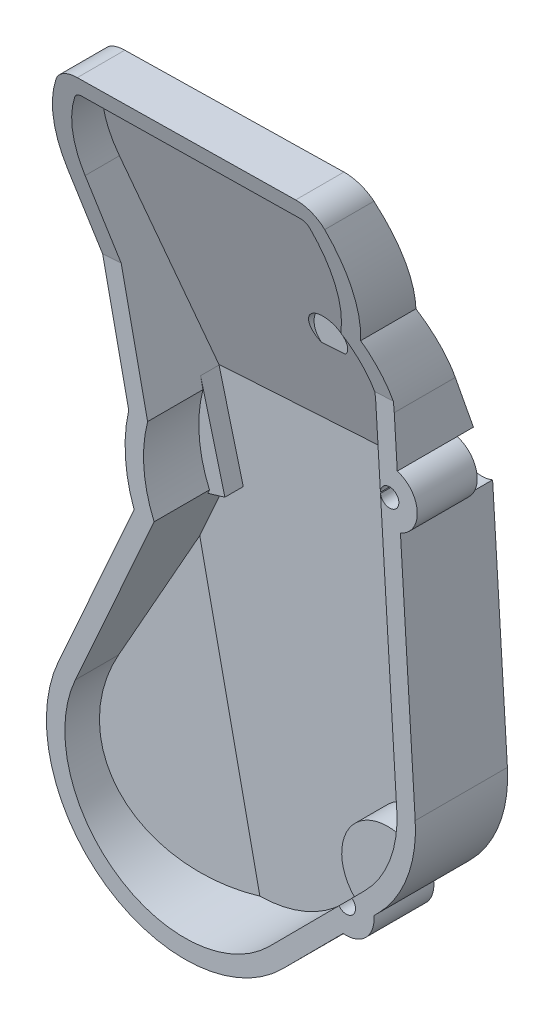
ISO-10303-21;
HEADER;
FILE_DESCRIPTION(('STEP AP214'),'2;1');
FILE_NAME('part.step','',(''),(''),'','','');
FILE_SCHEMA(('AUTOMOTIVE_DESIGN { 1 0 10303 214 1 1 1 1 }'));
ENDSEC;
DATA;
#1=APPLICATION_CONTEXT('core data for automotive mechanical design processes');
#2=APPLICATION_PROTOCOL_DEFINITION('international standard','automotive_design',2000,#1);
#3=PRODUCT_CONTEXT('',#1,'mechanical');
#4=PRODUCT('Part','Part','',(#3));
#5=PRODUCT_RELATED_PRODUCT_CATEGORY('part','',(#4));
#6=PRODUCT_DEFINITION_FORMATION('','',#4);
#7=PRODUCT_DEFINITION_CONTEXT('part definition',#1,'design');
#8=PRODUCT_DEFINITION('design','',#6,#7);
#9=PRODUCT_DEFINITION_SHAPE('','',#8);
#10=(LENGTH_UNIT() NAMED_UNIT(*) SI_UNIT(.MILLI.,.METRE.));
#11=(NAMED_UNIT(*) PLANE_ANGLE_UNIT() SI_UNIT($,.RADIAN.));
#12=(NAMED_UNIT(*) SI_UNIT($,.STERADIAN.) SOLID_ANGLE_UNIT());
#13=UNCERTAINTY_MEASURE_WITH_UNIT(LENGTH_MEASURE(1.E-05),#10,'distance_accuracy_value','');
#14=(GEOMETRIC_REPRESENTATION_CONTEXT(3) GLOBAL_UNCERTAINTY_ASSIGNED_CONTEXT((#13)) GLOBAL_UNIT_ASSIGNED_CONTEXT((#10,
#11,#12)) REPRESENTATION_CONTEXT('',''));
#15=CARTESIAN_POINT('',(0.,0.,0.));
#16=DIRECTION('',(0.,0.,1.));
#17=DIRECTION('',(1.,0.,0.));
#18=AXIS2_PLACEMENT_3D('',#15,#16,#17);
#19=CARTESIAN_POINT('',(17.2175409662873,-18.7638388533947,1.51471862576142));
#20=DIRECTION('',(0.,0.,1.));
#21=DIRECTION('',(-1.,0.,0.));
#22=AXIS2_PLACEMENT_3D('',#19,#20,#21);
#23=CYLINDRICAL_SURFACE('',#22,3.);
#24=CARTESIAN_POINT('',(17.2175409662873,-18.7638388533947,13.5));
#25=DIRECTION('',(0.,0.,1.));
#26=DIRECTION('',(1.,0.,0.));
#27=AXIS2_PLACEMENT_3D('',#24,#25,#26);
#28=CIRCLE('',#27,3.);
#29=CARTESIAN_POINT('',(18.3896520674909,-21.5253883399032,13.5));
#30=VERTEX_POINT('',#29);
#31=CARTESIAN_POINT('',(18.044673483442,-15.8801169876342,13.5));
#32=VERTEX_POINT('',#31);
#33=EDGE_CURVE('E766',#30,#32,#28,.T.);
#34=ORIENTED_EDGE('',*,*,#33,.T.);
#35=DIRECTION('',(0.,0.,1.));
#36=VECTOR('',#35,1.);
#37=CARTESIAN_POINT('',(18.044673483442,-15.8801169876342,1.51471862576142));
#38=LINE('',#37,#36);
#39=CARTESIAN_POINT('',(18.044673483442,-15.8801169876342,20.));
#40=VERTEX_POINT('',#39);
#41=EDGE_CURVE('E657',#40,#32,#38,.F.);
#42=ORIENTED_EDGE('',*,*,#41,.F.);
#43=CARTESIAN_POINT('',(17.2175409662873,-18.7638388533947,20.));
#44=DIRECTION('',(0.,0.,1.));
#45=DIRECTION('',(1.,0.,0.));
#46=AXIS2_PLACEMENT_3D('',#43,#44,#45);
#47=CIRCLE('',#46,3.);
#48=CARTESIAN_POINT('',(18.3896520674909,-21.5253883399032,20.));
#49=VERTEX_POINT('',#48);
#50=EDGE_CURVE('E649',#49,#40,#47,.T.);
#51=ORIENTED_EDGE('',*,*,#50,.F.);
#52=DIRECTION('',(0.,0.,1.));
#53=VECTOR('',#52,1.);
#54=CARTESIAN_POINT('',(18.3896520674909,-21.5253883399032,1.51471862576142));
#55=LINE('',#54,#53);
#56=EDGE_CURVE('E652',#30,#49,#55,.T.);
#57=ORIENTED_EDGE('',*,*,#56,.F.);
#58=EDGE_LOOP('',(#34,#42,#51,#57));
#59=FACE_BOUND('',#58,.T.);
#60=ADVANCED_FACE('F30',(#59),#23,.T.);
#61=CARTESIAN_POINT('',(12.5175409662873,-59.2638388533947,1.51471862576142));
#62=DIRECTION('',(0.,0.,1.));
#63=DIRECTION('',(-1.,0.,0.));
#64=AXIS2_PLACEMENT_3D('',#61,#62,#63);
#65=CYLINDRICAL_SURFACE('',#64,3.);
#66=CARTESIAN_POINT('',(12.5175409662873,-59.2638388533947,13.5));
#67=DIRECTION('',(0.,0.,1.));
#68=DIRECTION('',(1.,0.,0.));
#69=AXIS2_PLACEMENT_3D('',#66,#67,#68);
#70=CIRCLE('',#69,3.);
#71=CARTESIAN_POINT('',(12.181853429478,-62.244998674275,13.5));
#72=VERTEX_POINT('',#71);
#73=CARTESIAN_POINT('',(15.4970026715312,-58.9133992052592,13.5));
#74=VERTEX_POINT('',#73);
#75=EDGE_CURVE('E758',#72,#74,#70,.T.);
#76=ORIENTED_EDGE('',*,*,#75,.T.);
#77=DIRECTION('',(0.,0.,1.));
#78=VECTOR('',#77,1.);
#79=CARTESIAN_POINT('',(15.4970026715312,-58.9133992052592,1.51471862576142));
#80=LINE('',#79,#78);
#81=CARTESIAN_POINT('',(15.4970026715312,-58.9133992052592,20.));
#82=VERTEX_POINT('',#81);
#83=EDGE_CURVE('E668',#82,#74,#80,.F.);
#84=ORIENTED_EDGE('',*,*,#83,.F.);
#85=CARTESIAN_POINT('',(12.5175409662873,-59.2638388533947,20.));
#86=DIRECTION('',(0.,0.,1.));
#87=DIRECTION('',(1.,0.,0.));
#88=AXIS2_PLACEMENT_3D('',#85,#86,#87);
#89=CIRCLE('',#88,3.);
#90=CARTESIAN_POINT('',(12.181853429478,-62.244998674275,20.));
#91=VERTEX_POINT('',#90);
#92=EDGE_CURVE('E660',#91,#82,#89,.T.);
#93=ORIENTED_EDGE('',*,*,#92,.F.);
#94=DIRECTION('',(0.,0.,1.));
#95=VECTOR('',#94,1.);
#96=CARTESIAN_POINT('',(12.181853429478,-62.244998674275,1.51471862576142));
#97=LINE('',#96,#95);
#98=EDGE_CURVE('E663',#72,#91,#97,.T.);
#99=ORIENTED_EDGE('',*,*,#98,.F.);
#100=EDGE_LOOP('',(#76,#84,#93,#99));
#101=FACE_BOUND('',#100,.T.);
#102=ADVANCED_FACE('F781',(#101),#65,.T.);
#103=CARTESIAN_POINT('',(19.9914735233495,-47.7377887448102,10.));
#104=DIRECTION('',(-0.9981380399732,-0.0609955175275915,0.));
#105=DIRECTION('',(0.0609955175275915,-0.9981380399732,0.));
#106=AXIS2_PLACEMENT_3D('',#103,#104,#105);
#107=PLANE('',#106);
#108=DIRECTION('',(0.,0.,1.));
#109=VECTOR('',#108,1.);
#110=CARTESIAN_POINT('',(17.7188791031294,-10.5487782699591,10.));
#111=LINE('',#110,#109);
#112=CARTESIAN_POINT('',(17.7188791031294,-10.5487782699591,13.3797186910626));
#113=VERTEX_POINT('',#112);
#114=CARTESIAN_POINT('',(17.7188791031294,-10.5487782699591,20.));
#115=VERTEX_POINT('',#114);
#116=EDGE_CURVE('E725',#113,#115,#111,.T.);
#117=ORIENTED_EDGE('',*,*,#116,.T.);
#118=DIRECTION('',(0.0609955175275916,-0.9981380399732,0.));
#119=VECTOR('',#118,1.);
#120=CARTESIAN_POINT('',(21.8283369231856,-77.7964440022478,20.));
#121=LINE('',#120,#119);
#122=EDGE_CURVE('E672',#115,#40,#121,.T.);
#123=ORIENTED_EDGE('',*,*,#122,.T.);
#124=ORIENTED_EDGE('',*,*,#41,.T.);
#125=CARTESIAN_POINT('',(18.044673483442,-15.8801169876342,11.7381895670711));
#126=VERTEX_POINT('',#125);
#127=EDGE_CURVE('E656',#32,#126,#38,.F.);
#128=ORIENTED_EDGE('',*,*,#127,.T.);
#129=DIRECTION('',(-0.0583041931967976,0.954096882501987,0.293768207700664));
#130=VECTOR('',#129,1.);
#131=CARTESIAN_POINT('',(16.4049514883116,10.9524924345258,20.));
#132=LINE('',#131,#130);
#133=EDGE_CURVE('E619',#126,#113,#132,.T.);
#134=ORIENTED_EDGE('',*,*,#133,.T.);
#135=EDGE_LOOP('',(#117,#123,#124,#128,#134));
#136=FACE_BOUND('',#135,.T.);
#137=ADVANCED_FACE('F871',(#136),#107,.F.);
#138=CARTESIAN_POINT('',(18.3896520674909,-21.5253883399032,10.));
#139=VERTEX_POINT('',#138);
#140=EDGE_CURVE('E653',#139,#30,#55,.T.);
#141=ORIENTED_EDGE('',*,*,#140,.T.);
#142=ORIENTED_EDGE('',*,*,#56,.T.);
#143=CARTESIAN_POINT('',(19.9914735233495,-47.7377887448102,20.));
#144=VERTEX_POINT('',#143);
#145=EDGE_CURVE('E671',#49,#144,#121,.T.);
#146=ORIENTED_EDGE('',*,*,#145,.T.);
#147=DIRECTION('',(0.,0.,1.));
#148=VECTOR('',#147,1.);
#149=CARTESIAN_POINT('',(19.9914735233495,-47.7377887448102,10.));
#150=LINE('',#149,#148);
#151=CARTESIAN_POINT('',(19.9914735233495,-47.7377887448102,10.));
#152=VERTEX_POINT('',#151);
#153=EDGE_CURVE('E728',#152,#144,#150,.T.);
#154=ORIENTED_EDGE('',*,*,#153,.F.);
#155=DIRECTION('',(-0.0609955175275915,0.9981380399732,0.));
#156=VECTOR('',#155,1.);
#157=CARTESIAN_POINT('',(19.9914735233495,-47.7377887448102,10.));
#158=LINE('',#157,#156);
#159=EDGE_CURVE('E712',#152,#139,#158,.T.);
#160=ORIENTED_EDGE('',*,*,#159,.T.);
#161=EDGE_LOOP('',(#141,#142,#146,#154,#160));
#162=FACE_BOUND('',#161,.T.);
#163=ADVANCED_FACE('F874',(#162),#107,.F.);
#164=CARTESIAN_POINT('',(5.61527876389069,-68.8441575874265,10.));
#165=DIRECTION('',(-0.708854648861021,0.705354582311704,0.));
#166=DIRECTION('',(-0.705354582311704,-0.708854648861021,0.));
#167=AXIS2_PLACEMENT_3D('',#164,#165,#166);
#168=PLANE('',#167);
#169=ORIENTED_EDGE('',*,*,#83,.T.);
#170=CARTESIAN_POINT('',(15.4970026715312,-58.9133992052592,10.));
#171=VERTEX_POINT('',#170);
#172=EDGE_CURVE('E667',#74,#171,#80,.F.);
#173=ORIENTED_EDGE('',*,*,#172,.T.);
#174=DIRECTION('',(0.705354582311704,0.708854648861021,0.));
#175=VECTOR('',#174,1.);
#176=CARTESIAN_POINT('',(5.61527876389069,-68.8441575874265,10.));
#177=LINE('',#176,#175);
#178=CARTESIAN_POINT('',(15.9415060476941,-58.4666901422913,10.));
#179=VERTEX_POINT('',#178);
#180=EDGE_CURVE('E706',#171,#179,#177,.T.);
#181=ORIENTED_EDGE('',*,*,#180,.T.);
#182=DIRECTION('',(0.,0.,1.));
#183=VECTOR('',#182,1.);
#184=CARTESIAN_POINT('',(15.9415060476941,-58.4666901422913,10.));
#185=LINE('',#184,#183);
#186=CARTESIAN_POINT('',(15.9415060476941,-58.4666901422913,20.));
#187=VERTEX_POINT('',#186);
#188=EDGE_CURVE('E731',#179,#187,#185,.T.);
#189=ORIENTED_EDGE('',*,*,#188,.T.);
#190=DIRECTION('',(0.705354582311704,0.708854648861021,0.));
#191=VECTOR('',#190,1.);
#192=CARTESIAN_POINT('',(5.61527876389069,-68.8441575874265,20.));
#193=LINE('',#192,#191);
#194=EDGE_CURVE('E796',#82,#187,#193,.T.);
#195=ORIENTED_EDGE('',*,*,#194,.F.);
#196=EDGE_LOOP('',(#169,#173,#181,#189,#195));
#197=FACE_BOUND('',#196,.T.);
#198=ADVANCED_FACE('F794',(#197),#168,.F.);
#199=CARTESIAN_POINT('',(12.181853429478,-62.244998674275,10.));
#200=VERTEX_POINT('',#199);
#201=EDGE_CURVE('E664',#200,#72,#97,.T.);
#202=ORIENTED_EDGE('',*,*,#201,.T.);
#203=ORIENTED_EDGE('',*,*,#98,.T.);
#204=CARTESIAN_POINT('',(5.61527876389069,-68.8441575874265,20.));
#205=VERTEX_POINT('',#204);
#206=EDGE_CURVE('E799',#205,#91,#193,.T.);
#207=ORIENTED_EDGE('',*,*,#206,.F.);
#208=DIRECTION('',(0.,0.,1.));
#209=VECTOR('',#208,1.);
#210=CARTESIAN_POINT('',(5.61527876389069,-68.8441575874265,10.));
#211=LINE('',#210,#209);
#212=CARTESIAN_POINT('',(5.61527876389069,-68.8441575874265,10.));
#213=VERTEX_POINT('',#212);
#214=EDGE_CURVE('E734',#213,#205,#211,.T.);
#215=ORIENTED_EDGE('',*,*,#214,.F.);
#216=EDGE_CURVE('E707',#213,#200,#177,.T.);
#217=ORIENTED_EDGE('',*,*,#216,.T.);
#218=EDGE_LOOP('',(#202,#203,#207,#215,#217));
#219=FACE_BOUND('',#218,.T.);
#220=ADVANCED_FACE('F808',(#219),#168,.F.);
#221=CARTESIAN_POINT('',(-11.6660385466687,5.73616114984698,10.));
#222=DIRECTION('',(0.,0.,1.));
#223=DIRECTION('',(-1.,0.,0.));
#224=AXIS2_PLACEMENT_3D('',#221,#222,#223);
#225=CYLINDRICAL_SURFACE('',#224,3.);
#226=DIRECTION('',(0.,0.,1.));
#227=VECTOR('',#226,1.);
#228=CARTESIAN_POINT('',(-14.358201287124,7.05989064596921,10.));
#229=LINE('',#228,#227);
#230=CARTESIAN_POINT('',(-14.358201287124,7.05989064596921,19.3825955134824));
#231=VERTEX_POINT('',#230);
#232=CARTESIAN_POINT('',(-14.358201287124,7.05989064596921,24.622765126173));
#233=VERTEX_POINT('',#232);
#234=EDGE_CURVE('E749',#231,#233,#229,.T.);
#235=ORIENTED_EDGE('',*,*,#234,.T.);
#236=CARTESIAN_POINT('',(-11.6660385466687,5.73616114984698,24.2513964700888));
#237=DIRECTION('',(0.014793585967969,-0.24208403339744,0.970142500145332));
#238=DIRECTION('',(-0.0591743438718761,0.968336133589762,0.242535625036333));
#239=AXIS2_PLACEMENT_3D('',#236,#237,#238);
#240=ELLIPSE('',#239,3.09232921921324,3.);
#241=CARTESIAN_POINT('',(-12.0313302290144,8.71383843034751,25.));
#242=VERTEX_POINT('',#241);
#243=EDGE_CURVE('E686',#242,#233,#240,.T.);
#244=ORIENTED_EDGE('',*,*,#243,.F.);
#245=CARTESIAN_POINT('',(-11.6660385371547,8.736161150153,25.));
#246=DIRECTION('',(-0.998138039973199,-0.0609955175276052,0.));
#247=VECTOR('',#246,1.);
#248=LINE('',#245,#247);
#249=CARTESIAN_POINT('',(-11.6660385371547,8.73616115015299,25.));
#250=VERTEX_POINT('',#249);
#251=EDGE_CURVE('E754',#250,#242,#248,.T.);
#252=ORIENTED_EDGE('',*,*,#251,.F.);
#253=DIRECTION('',(0.,0.,1.));
#254=VECTOR('',#253,1.);
#255=CARTESIAN_POINT('',(-11.6660385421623,8.73616114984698,10.));
#256=LINE('',#255,#254);
#257=CARTESIAN_POINT('',(-11.6660385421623,8.73616114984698,19.8463357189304));
#258=VERTEX_POINT('',#257);
#259=EDGE_CURVE('E715',#258,#250,#256,.T.);
#260=ORIENTED_EDGE('',*,*,#259,.F.);
#261=CARTESIAN_POINT('',(-11.6660385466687,5.73616114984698,18.9260667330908));
#262=DIRECTION('',(-0.017918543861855,0.293221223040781,-0.955876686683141));
#263=DIRECTION('',(-0.0583041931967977,0.954096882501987,0.293768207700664));
#264=AXIS2_PLACEMENT_3D('',#261,#262,#263);
#265=ELLIPSE('',#264,3.13848014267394,3.);
#266=EDGE_CURVE('E634',#231,#258,#265,.T.);
#267=ORIENTED_EDGE('',*,*,#266,.F.);
#268=EDGE_LOOP('',(#235,#244,#252,#260,#267));
#269=FACE_BOUND('',#268,.T.);
#270=ADVANCED_FACE('F32',(#269),#225,.T.);
#271=CARTESIAN_POINT('',(-2.63150674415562E-09,4.1818082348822E-09,10.));
#272=DIRECTION('',(0.,0.,1.));
#273=DIRECTION('',(-1.,0.,0.));
#274=AXIS2_PLACEMENT_3D('',#271,#272,#273);
#275=CYLINDRICAL_SURFACE('',#274,16.);
#276=DIRECTION('',(0.,0.,1.));
#277=VECTOR('',#276,1.);
#278=CARTESIAN_POINT('',(-15.6488350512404,-3.33376087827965,10.));
#279=LINE('',#278,#277);
#280=CARTESIAN_POINT('',(-15.6488350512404,-3.33376087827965,16.2184709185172));
#281=VERTEX_POINT('',#280);
#282=CARTESIAN_POINT('',(-15.6488350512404,-3.33376087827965,22.0488711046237));
#283=VERTEX_POINT('',#282);
#284=EDGE_CURVE('E746',#281,#283,#279,.T.);
#285=ORIENTED_EDGE('',*,*,#284,.T.);
#286=CARTESIAN_POINT('',(-2.63150674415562E-09,4.1818082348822E-09,22.6421322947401));
#287=DIRECTION('',(0.014793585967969,-0.24208403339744,0.970142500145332));
#288=DIRECTION('',(-0.0591743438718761,0.968336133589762,0.242535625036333));
#289=AXIS2_PLACEMENT_3D('',#286,#287,#288);
#290=ELLIPSE('',#289,16.4924225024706,16.);
#291=EDGE_CURVE('E821',#233,#283,#290,.T.);
#292=ORIENTED_EDGE('',*,*,#291,.F.);
#293=ORIENTED_EDGE('',*,*,#234,.F.);
#294=CARTESIAN_POINT('',(-2.63150674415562E-09,4.1818082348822E-09,16.9477753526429));
#295=DIRECTION('',(-0.017918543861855,0.293221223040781,-0.955876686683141));
#296=DIRECTION('',(-0.0583041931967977,0.954096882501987,0.293768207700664));
#297=AXIS2_PLACEMENT_3D('',#294,#295,#296);
#298=ELLIPSE('',#297,16.7385607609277,16.);
#299=EDGE_CURVE('E637',#281,#231,#298,.T.);
#300=ORIENTED_EDGE('',*,*,#299,.F.);
#301=EDGE_LOOP('',(#285,#292,#293,#300));
#302=FACE_BOUND('',#301,.T.);
#303=ADVANCED_FACE('F894',(#302),#275,.T.);
#304=CARTESIAN_POINT('',(-15.6488350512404,-3.33376087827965,10.));
#305=DIRECTION('',(0.978052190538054,0.208360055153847,0.));
#306=DIRECTION('',(-0.208360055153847,0.978052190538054,0.));
#307=AXIS2_PLACEMENT_3D('',#304,#305,#306);
#308=PLANE('',#307);
#309=DIRECTION('',(-0.208360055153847,0.978052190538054,0.));
#310=VECTOR('',#309,1.);
#311=CARTESIAN_POINT('',(-15.6488350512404,-3.33376087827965,12.));
#312=LINE('',#311,#310);
#313=CARTESIAN_POINT('',(-11.0890507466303,-24.7376092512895,12.));
#314=VERTEX_POINT('',#313);
#315=CARTESIAN_POINT('',(-11.2373947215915,-24.0412754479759,12.));
#316=VERTEX_POINT('',#315);
#317=EDGE_CURVE('E606',#314,#316,#312,.T.);
#318=ORIENTED_EDGE('',*,*,#317,.F.);
#319=DIRECTION('',(0.,0.,1.));
#320=VECTOR('',#319,1.);
#321=CARTESIAN_POINT('',(-11.0890507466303,-24.7376092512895,10.));
#322=LINE('',#321,#320);
#323=CARTESIAN_POINT('',(-11.0890507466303,-24.7376092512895,20.));
#324=VERTEX_POINT('',#323);
#325=EDGE_CURVE('E743',#314,#324,#322,.T.);
#326=ORIENTED_EDGE('',*,*,#325,.T.);
#327=DIRECTION('',(0.208360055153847,-0.978052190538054,0.));
#328=VECTOR('',#327,1.);
#329=CARTESIAN_POINT('',(-15.6488350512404,-3.33376087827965,20.));
#330=LINE('',#329,#328);
#331=CARTESIAN_POINT('',(-13.9221262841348,-11.4390154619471,20.));
#332=VERTEX_POINT('',#331);
#333=EDGE_CURVE('E692',#332,#324,#330,.T.);
#334=ORIENTED_EDGE('',*,*,#333,.F.);
#335=DIRECTION('',(0.202269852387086,-0.949464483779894,-0.240008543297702));
#336=VECTOR('',#335,1.);
#337=CARTESIAN_POINT('',(-15.0639046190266,-6.07945265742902,21.3548067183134));
#338=LINE('',#337,#336);
#339=EDGE_CURVE('E1105',#283,#332,#338,.T.);
#340=ORIENTED_EDGE('',*,*,#339,.F.);
#341=ORIENTED_EDGE('',*,*,#284,.F.);
#342=DIRECTION('',(-0.199355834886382,0.935785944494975,0.290795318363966));
#343=VECTOR('',#342,1.);
#344=CARTESIAN_POINT('',(-15.2883394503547,-5.02594468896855,15.6926250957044));
#345=LINE('',#344,#343);
#346=CARTESIAN_POINT('',(-11.3857386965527,-23.3449416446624,10.));
#347=VERTEX_POINT('',#346);
#348=EDGE_CURVE('E639',#347,#281,#345,.T.);
#349=ORIENTED_EDGE('',*,*,#348,.F.);
#350=DIRECTION('',(0.208360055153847,-0.978052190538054,0.));
#351=VECTOR('',#350,1.);
#352=CARTESIAN_POINT('',(-15.6488350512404,-3.33376087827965,10.));
#353=LINE('',#352,#351);
#354=CARTESIAN_POINT('',(-11.2373947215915,-24.0412754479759,10.));
#355=VERTEX_POINT('',#354);
#356=EDGE_CURVE('E695',#347,#355,#353,.T.);
#357=ORIENTED_EDGE('',*,*,#356,.T.);
#358=DIRECTION('',(0.,0.,-1.));
#359=VECTOR('',#358,1.);
#360=CARTESIAN_POINT('',(-11.2373947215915,-24.0412754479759,12.));
#361=LINE('',#360,#359);
#362=EDGE_CURVE('E603',#316,#355,#361,.T.);
#363=ORIENTED_EDGE('',*,*,#362,.F.);
#364=EDGE_LOOP('',(#318,#326,#334,#340,#341,#349,#357,#363));
#365=FACE_BOUND('',#364,.T.);
#366=ADVANCED_FACE('F891',(#365),#308,.F.);
#367=CARTESIAN_POINT('',(4.51754096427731,-28.2638388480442,10.));
#368=DIRECTION('',(0.,0.,1.));
#369=DIRECTION('',(-1.,0.,0.));
#370=AXIS2_PLACEMENT_3D('',#367,#368,#369);
#371=CYLINDRICAL_SURFACE('',#370,16.);
#372=CARTESIAN_POINT('',(4.51754096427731,-28.2638388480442,10.));
#373=DIRECTION('',(0.,0.,1.));
#374=DIRECTION('',(1.,0.,0.));
#375=AXIS2_PLACEMENT_3D('',#372,#373,#374);
#376=CIRCLE('',#375,16.);
#377=CARTESIAN_POINT('',(-10.8159278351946,-32.8338207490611,10.));
#378=VERTEX_POINT('',#377);
#379=CARTESIAN_POINT('',(-10.5006689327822,-33.7822961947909,10.));
#380=VERTEX_POINT('',#379);
#381=EDGE_CURVE('E698',#378,#380,#376,.T.);
#382=ORIENTED_EDGE('',*,*,#381,.T.);
#383=DIRECTION('',(0.,0.,1.));
#384=VECTOR('',#383,1.);
#385=CARTESIAN_POINT('',(-10.5006689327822,-33.7822961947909,10.));
#386=LINE('',#385,#384);
#387=CARTESIAN_POINT('',(-10.5006689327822,-33.7822961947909,20.));
#388=VERTEX_POINT('',#387);
#389=EDGE_CURVE('E740',#380,#388,#386,.T.);
#390=ORIENTED_EDGE('',*,*,#389,.T.);
#391=CARTESIAN_POINT('',(4.51754096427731,-28.2638388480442,20.));
#392=DIRECTION('',(0.,0.,1.));
#393=DIRECTION('',(1.,0.,0.));
#394=AXIS2_PLACEMENT_3D('',#391,#392,#393);
#395=CIRCLE('',#394,16.);
#396=EDGE_CURVE('E828',#324,#388,#395,.T.);
#397=ORIENTED_EDGE('',*,*,#396,.F.);
#398=ORIENTED_EDGE('',*,*,#325,.F.);
#399=CARTESIAN_POINT('',(4.51754096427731,-28.2638388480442,12.));
#400=DIRECTION('',(0.,0.,-1.));
#401=DIRECTION('',(-1.,0.,0.));
#402=AXIS2_PLACEMENT_3D('',#399,#400,#401);
#403=CIRCLE('',#402,16.);
#404=CARTESIAN_POINT('',(-10.8159278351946,-32.8338207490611,12.));
#405=VERTEX_POINT('',#404);
#406=EDGE_CURVE('E11',#405,#314,#403,.T.);
#407=ORIENTED_EDGE('',*,*,#406,.F.);
#408=DIRECTION('',(0.,0.,-1.));
#409=VECTOR('',#408,1.);
#410=CARTESIAN_POINT('',(-10.8159278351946,-32.8338207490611,12.));
#411=LINE('',#410,#409);
#412=EDGE_CURVE('E602',#405,#378,#411,.T.);
#413=ORIENTED_EDGE('',*,*,#412,.T.);
#414=EDGE_LOOP('',(#382,#390,#397,#398,#407,#413));
#415=FACE_BOUND('',#414,.T.);
#416=ADVANCED_FACE('F887',(#415),#371,.T.);
#417=CARTESIAN_POINT('',(-10.5006689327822,-33.7822961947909,10.));
#418=DIRECTION('',(0.912869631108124,-0.408251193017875,0.));
#419=DIRECTION('',(0.408251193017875,0.912869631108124,0.));
#420=AXIS2_PLACEMENT_3D('',#417,#418,#419);
#421=PLANE('',#420);
#422=ORIENTED_EDGE('',*,*,#389,.F.);
#423=DIRECTION('',(-0.408251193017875,-0.912869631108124,0.));
#424=VECTOR('',#423,1.);
#425=CARTESIAN_POINT('',(-10.5006689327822,-33.7822961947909,10.));
#426=LINE('',#425,#424);
#427=CARTESIAN_POINT('',(-12.3642420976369,-37.9493369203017,10.));
#428=VERTEX_POINT('',#427);
#429=EDGE_CURVE('E701',#380,#428,#426,.T.);
#430=ORIENTED_EDGE('',*,*,#429,.T.);
#431=DIRECTION('',(0.396555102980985,0.88671660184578,-0.237650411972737));
#432=VECTOR('',#431,1.);
#433=CARTESIAN_POINT('',(-10.6059192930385,-34.017641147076,8.94625958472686));
#434=LINE('',#433,#432);
#435=CARTESIAN_POINT('',(-18.7105854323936,-52.1400709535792,13.8032825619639));
#436=VERTEX_POINT('',#435);
#437=EDGE_CURVE('E691',#436,#428,#434,.T.);
#438=ORIENTED_EDGE('',*,*,#437,.F.);
#439=DIRECTION('',(0.,0.,1.));
#440=VECTOR('',#439,1.);
#441=CARTESIAN_POINT('',(-18.7105854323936,-52.1400709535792,10.));
#442=LINE('',#441,#440);
#443=CARTESIAN_POINT('',(-18.7105854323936,-52.1400709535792,20.));
#444=VERTEX_POINT('',#443);
#445=EDGE_CURVE('E737',#436,#444,#442,.T.);
#446=ORIENTED_EDGE('',*,*,#445,.T.);
#447=DIRECTION('',(-0.408251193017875,-0.912869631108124,0.));
#448=VECTOR('',#447,1.);
#449=CARTESIAN_POINT('',(-10.5006689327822,-33.7822961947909,20.));
#450=LINE('',#449,#448);
#451=EDGE_CURVE('E826',#388,#444,#450,.T.);
#452=ORIENTED_EDGE('',*,*,#451,.F.);
#453=EDGE_LOOP('',(#422,#430,#438,#446,#452));
#454=FACE_BOUND('',#453,.T.);
#455=ADVANCED_FACE('F883',(#454),#421,.F.);
#456=CARTESIAN_POINT('',(-5.01754096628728,-58.26383885,10.));
#457=DIRECTION('',(0.,0.,1.));
#458=DIRECTION('',(-1.,0.,0.));
#459=AXIS2_PLACEMENT_3D('',#456,#457,#458);
#460=CYLINDRICAL_SURFACE('',#459,15.);
#461=ORIENTED_EDGE('',*,*,#445,.F.);
#462=CARTESIAN_POINT('',(-5.01754096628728,-58.26383885,8.77452505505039));
#463=DIRECTION('',(-0.374915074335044,-0.0798703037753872,-0.923612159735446));
#464=DIRECTION('',(-0.903340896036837,-0.192443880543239,0.383328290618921));
#465=AXIS2_PLACEMENT_3D('',#462,#463,#464);
#466=ELLIPSE('',#465,16.2405830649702,15.);
#467=CARTESIAN_POINT('',(-4.84121245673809,-73.2628024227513,10.));
#468=VERTEX_POINT('',#467);
#469=EDGE_CURVE('E689',#468,#436,#466,.T.);
#470=ORIENTED_EDGE('',*,*,#469,.F.);
#471=CARTESIAN_POINT('',(-5.01754096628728,-58.26383885,10.));
#472=DIRECTION('',(0.,0.,1.));
#473=DIRECTION('',(1.,0.,0.));
#474=AXIS2_PLACEMENT_3D('',#471,#472,#473);
#475=CIRCLE('',#474,15.);
#476=EDGE_CURVE('E704',#468,#213,#475,.T.);
#477=ORIENTED_EDGE('',*,*,#476,.T.);
#478=ORIENTED_EDGE('',*,*,#214,.T.);
#479=CARTESIAN_POINT('',(-5.01754096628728,-58.26383885,20.));
#480=DIRECTION('',(0.,0.,1.));
#481=DIRECTION('',(1.,0.,0.));
#482=AXIS2_PLACEMENT_3D('',#479,#480,#481);
#483=CIRCLE('',#482,15.);
#484=EDGE_CURVE('E805',#444,#205,#483,.T.);
#485=ORIENTED_EDGE('',*,*,#484,.F.);
#486=EDGE_LOOP('',(#461,#470,#477,#478,#485));
#487=FACE_BOUND('',#486,.T.);
#488=ADVANCED_FACE('F878',(#487),#460,.T.);
#489=CARTESIAN_POINT('',(6.01754096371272,-48.59172599,10.));
#490=DIRECTION('',(0.,0.,1.));
#491=DIRECTION('',(-1.,0.,0.));
#492=AXIS2_PLACEMENT_3D('',#489,#490,#491);
#493=CYLINDRICAL_SURFACE('',#492,13.9999999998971);
#494=ORIENTED_EDGE('',*,*,#188,.F.);
#495=CARTESIAN_POINT('',(6.01754096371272,-48.59172599,10.));
#496=DIRECTION('',(0.,0.,1.));
#497=DIRECTION('',(1.,0.,0.));
#498=AXIS2_PLACEMENT_3D('',#495,#496,#497);
#499=CIRCLE('',#498,13.9999999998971);
#500=EDGE_CURVE('E710',#179,#152,#499,.T.);
#501=ORIENTED_EDGE('',*,*,#500,.T.);
#502=ORIENTED_EDGE('',*,*,#153,.T.);
#503=CARTESIAN_POINT('',(6.01754096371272,-48.59172599,20.));
#504=DIRECTION('',(0.,0.,1.));
#505=DIRECTION('',(1.,0.,0.));
#506=AXIS2_PLACEMENT_3D('',#503,#504,#505);
#507=CIRCLE('',#506,13.9999999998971);
#508=EDGE_CURVE('E800',#187,#144,#507,.T.);
#509=ORIENTED_EDGE('',*,*,#508,.F.);
#510=EDGE_LOOP('',(#494,#501,#502,#509));
#511=FACE_BOUND('',#510,.T.);
#512=ADVANCED_FACE('F817',(#511),#493,.T.);
#513=CARTESIAN_POINT('',(6.01754096,-11.26383886,10.));
#514=DIRECTION('',(0.,0.,1.));
#515=DIRECTION('',(-1.,0.,0.));
#516=AXIS2_PLACEMENT_3D('',#513,#514,#515);
#517=CYLINDRICAL_SURFACE('',#516,11.72316621);
#518=DIRECTION('',(0.,0.,1.));
#519=VECTOR('',#518,1.);
#520=CARTESIAN_POINT('',(15.4214032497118,-4.26383885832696,10.));
#521=LINE('',#520,#519);
#522=CARTESIAN_POINT('',(15.4214032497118,-4.26383885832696,15.3507313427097));
#523=VERTEX_POINT('',#522);
#524=CARTESIAN_POINT('',(15.4214032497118,-4.26383885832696,21.342998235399));
#525=VERTEX_POINT('',#524);
#526=EDGE_CURVE('E722',#523,#525,#521,.T.);
#527=ORIENTED_EDGE('',*,*,#526,.T.);
#528=CARTESIAN_POINT('',(6.01754096,-11.26383886,19.7396550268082));
#529=DIRECTION('',(0.014793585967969,-0.24208403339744,0.970142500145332));
#530=DIRECTION('',(-0.0591743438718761,0.968336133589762,0.242535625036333));
#531=AXIS2_PLACEMENT_3D('',#528,#529,#530);
#532=ELLIPSE('',#531,12.0839631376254,11.72316621);
#533=CARTESIAN_POINT('',(17.6091009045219,-9.51216422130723,20.));
#534=VERTEX_POINT('',#533);
#535=EDGE_CURVE('E1108',#534,#525,#532,.T.);
#536=ORIENTED_EDGE('',*,*,#535,.F.);
#537=CARTESIAN_POINT('',(6.01754096,-11.26383886,20.));
#538=DIRECTION('',(0.,0.,1.));
#539=DIRECTION('',(1.,0.,0.));
#540=AXIS2_PLACEMENT_3D('',#537,#538,#539);
#541=CIRCLE('',#540,11.72316621);
#542=EDGE_CURVE('E755',#115,#534,#541,.T.);
#543=ORIENTED_EDGE('',*,*,#542,.F.);
#544=ORIENTED_EDGE('',*,*,#116,.F.);
#545=CARTESIAN_POINT('',(6.01754096,-11.26383886,13.3797186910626));
#546=DIRECTION('',(-0.017918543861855,0.293221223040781,-0.955876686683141));
#547=DIRECTION('',(-0.0583041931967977,0.954096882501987,0.293768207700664));
#548=AXIS2_PLACEMENT_3D('',#545,#546,#547);
#549=ELLIPSE('',#548,12.2643081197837,11.72316621);
#550=EDGE_CURVE('E632',#523,#113,#549,.T.);
#551=ORIENTED_EDGE('',*,*,#550,.F.);
#552=EDGE_LOOP('',(#527,#536,#543,#544,#551));
#553=FACE_BOUND('',#552,.T.);
#554=ADVANCED_FACE('F866',(#553),#517,.T.);
#555=CARTESIAN_POINT('',(0.,0.,10.));
#556=DIRECTION('',(0.,0.,1.));
#557=DIRECTION('',(-1.,0.,0.));
#558=AXIS2_PLACEMENT_3D('',#555,#556,#557);
#559=CYLINDRICAL_SURFACE('',#558,16.);
#560=DIRECTION('',(0.,0.,1.));
#561=VECTOR('',#560,1.);
#562=CARTESIAN_POINT('',(14.3582012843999,7.05989064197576,10.));
#563=LINE('',#562,#561);
#564=CARTESIAN_POINT('',(14.3582012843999,7.05989064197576,18.8442874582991));
#565=VERTEX_POINT('',#564);
#566=CARTESIAN_POINT('',(14.3582012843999,7.05989064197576,24.1848721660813));
#567=VERTEX_POINT('',#566);
#568=EDGE_CURVE('E719',#565,#567,#563,.T.);
#569=ORIENTED_EDGE('',*,*,#568,.T.);
#570=CARTESIAN_POINT('',(0.,0.,22.6421322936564));
#571=DIRECTION('',(0.014793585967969,-0.24208403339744,0.970142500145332));
#572=DIRECTION('',(-0.0591743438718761,0.968336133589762,0.242535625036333));
#573=AXIS2_PLACEMENT_3D('',#570,#571,#572);
#574=ELLIPSE('',#573,16.4924225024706,16.);
#575=EDGE_CURVE('E1141',#525,#567,#574,.T.);
#576=ORIENTED_EDGE('',*,*,#575,.F.);
#577=ORIENTED_EDGE('',*,*,#526,.F.);
#578=CARTESIAN_POINT('',(0.,0.,16.9477753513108));
#579=DIRECTION('',(-0.017918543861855,0.293221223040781,-0.955876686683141));
#580=DIRECTION('',(-0.0583041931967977,0.954096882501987,0.293768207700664));
#581=AXIS2_PLACEMENT_3D('',#578,#579,#580);
#582=ELLIPSE('',#581,16.7385607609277,16.);
#583=EDGE_CURVE('E630',#565,#523,#582,.T.);
#584=ORIENTED_EDGE('',*,*,#583,.F.);
#585=EDGE_LOOP('',(#569,#576,#577,#584));
#586=FACE_BOUND('',#585,.T.);
#587=ADVANCED_FACE('F862',(#586),#559,.T.);
#588=CARTESIAN_POINT('',(11.6660385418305,5.73616115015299,10.));
#589=DIRECTION('',(0.,0.,1.));
#590=DIRECTION('',(-1.,0.,0.));
#591=AXIS2_PLACEMENT_3D('',#588,#589,#590);
#592=CYLINDRICAL_SURFACE('',#591,3.);
#593=DIRECTION('',(0.,0.,1.));
#594=VECTOR('',#593,1.);
#595=CARTESIAN_POINT('',(11.6660385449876,8.73616115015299,10.));
#596=LINE('',#595,#594);
#597=CARTESIAN_POINT('',(11.6660385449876,8.73616115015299,19.4089604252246));
#598=VERTEX_POINT('',#597);
#599=CARTESIAN_POINT('',(11.6660385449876,8.73616115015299,24.6442119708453));
#600=VERTEX_POINT('',#599);
#601=EDGE_CURVE('E716',#598,#600,#596,.T.);
#602=ORIENTED_EDGE('',*,*,#601,.T.);
#603=CARTESIAN_POINT('',(11.6660385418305,5.73616115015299,23.8956084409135));
#604=DIRECTION('',(0.014793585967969,-0.24208403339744,0.970142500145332));
#605=DIRECTION('',(-0.0591743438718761,0.968336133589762,0.242535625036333));
#606=AXIS2_PLACEMENT_3D('',#603,#604,#605);
#607=ELLIPSE('',#606,3.09232921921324,3.);
#608=EDGE_CURVE('E681',#567,#600,#607,.T.);
#609=ORIENTED_EDGE('',*,*,#608,.F.);
#610=ORIENTED_EDGE('',*,*,#568,.F.);
#611=CARTESIAN_POINT('',(11.6660385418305,5.73616115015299,18.4886914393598));
#612=DIRECTION('',(-0.017918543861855,0.293221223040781,-0.955876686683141));
#613=DIRECTION('',(-0.0583041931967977,0.954096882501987,0.293768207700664));
#614=AXIS2_PLACEMENT_3D('',#611,#612,#613);
#615=ELLIPSE('',#614,3.13848014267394,3.);
#616=EDGE_CURVE('E628',#598,#565,#615,.T.);
#617=ORIENTED_EDGE('',*,*,#616,.F.);
#618=EDGE_LOOP('',(#602,#609,#610,#617));
#619=FACE_BOUND('',#618,.T.);
#620=ADVANCED_FACE('F858',(#619),#592,.T.);
#621=CARTESIAN_POINT('',(11.6660385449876,8.73616115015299,10.));
#622=DIRECTION('',(1.31155129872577E-11,-1.,0.));
#623=DIRECTION('',(1.,1.31155129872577E-11,0.));
#624=AXIS2_PLACEMENT_3D('',#621,#622,#623);
#625=PLANE('',#624);
#626=ORIENTED_EDGE('',*,*,#259,.T.);
#627=DIRECTION('',(-0.999883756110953,-1.31139883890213E-11,0.0152471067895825));
#628=VECTOR('',#627,1.);
#629=CARTESIAN_POINT('',(11.8892944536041,8.73616115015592,24.6408075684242));
#630=LINE('',#629,#628);
#631=EDGE_CURVE('E678',#600,#250,#630,.T.);
#632=ORIENTED_EDGE('',*,*,#631,.F.);
#633=ORIENTED_EDGE('',*,*,#601,.F.);
#634=DIRECTION('',(0.999824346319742,1.31132091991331E-11,-0.0187423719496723));
#635=VECTOR('',#634,1.);
#636=CARTESIAN_POINT('',(11.8423538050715,8.7361611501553,19.4056552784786));
#637=LINE('',#636,#635);
#638=EDGE_CURVE('E626',#258,#598,#637,.T.);
#639=ORIENTED_EDGE('',*,*,#638,.F.);
#640=EDGE_LOOP('',(#626,#632,#633,#639));
#641=FACE_BOUND('',#640,.T.);
#642=ADVANCED_FACE('F855',(#641),#625,.F.);
#643=CARTESIAN_POINT('',(-11.6660385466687,5.73616114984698,10.));
#644=DIRECTION('',(0.,0.,-1.));
#645=DIRECTION('',(1.,0.,0.));
#646=AXIS2_PLACEMENT_3D('',#643,#644,#645);
#647=PLANE('',#646);
#648=DIRECTION('',(-0.252082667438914,0.967705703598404,0.));
#649=VECTOR('',#648,1.);
#650=CARTESIAN_POINT('',(-9.08162658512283,-32.316930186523,10.));
#651=LINE('',#650,#649);
#652=CARTESIAN_POINT('',(-9.08162658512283,-32.316930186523,10.));
#653=VERTEX_POINT('',#652);
#654=EDGE_CURVE('E595',#653,#355,#651,.T.);
#655=ORIENTED_EDGE('',*,*,#654,.T.);
#656=ORIENTED_EDGE('',*,*,#356,.F.);
#657=DIRECTION('',(0.9981380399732,0.0609955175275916,0.));
#658=VECTOR('',#657,1.);
#659=CARTESIAN_POINT('',(-23.0245863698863,-24.0561834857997,10.));
#660=LINE('',#659,#658);
#661=CARTESIAN_POINT('',(16.3904084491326,-21.6475607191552,10.));
#662=VERTEX_POINT('',#661);
#663=EDGE_CURVE('E623',#347,#662,#660,.T.);
#664=ORIENTED_EDGE('',*,*,#663,.T.);
#665=CARTESIAN_POINT('',(17.2175409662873,-18.7638388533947,10.));
#666=DIRECTION('',(0.,0.,1.));
#667=DIRECTION('',(1.,0.,0.));
#668=AXIS2_PLACEMENT_3D('',#665,#666,#667);
#669=CIRCLE('',#668,3.);
#670=EDGE_CURVE('E641',#662,#139,#669,.T.);
#671=ORIENTED_EDGE('',*,*,#670,.T.);
#672=ORIENTED_EDGE('',*,*,#159,.F.);
#673=ORIENTED_EDGE('',*,*,#500,.F.);
#674=ORIENTED_EDGE('',*,*,#180,.F.);
#675=CARTESIAN_POINT('',(12.5175409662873,-59.2638388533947,10.));
#676=DIRECTION('',(0.,0.,1.));
#677=DIRECTION('',(1.,0.,0.));
#678=AXIS2_PLACEMENT_3D('',#675,#676,#677);
#679=CIRCLE('',#678,3.);
#680=EDGE_CURVE('E645',#171,#200,#679,.T.);
#681=ORIENTED_EDGE('',*,*,#680,.T.);
#682=ORIENTED_EDGE('',*,*,#216,.F.);
#683=ORIENTED_EDGE('',*,*,#476,.F.);
#684=DIRECTION('',(-0.208360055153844,0.978052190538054,0.));
#685=VECTOR('',#684,1.);
#686=CARTESIAN_POINT('',(-21.2364673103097,3.69731794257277,10.));
#687=LINE('',#686,#685);
#688=EDGE_CURVE('E752',#468,#428,#687,.T.);
#689=ORIENTED_EDGE('',*,*,#688,.T.);
#690=ORIENTED_EDGE('',*,*,#429,.F.);
#691=ORIENTED_EDGE('',*,*,#381,.F.);
#692=DIRECTION('',(0.958341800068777,0.285623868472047,0.));
#693=VECTOR('',#692,1.);
#694=CARTESIAN_POINT('',(-10.8159278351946,-32.8338207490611,10.));
#695=LINE('',#694,#693);
#696=EDGE_CURVE('E54',#378,#653,#695,.T.);
#697=ORIENTED_EDGE('',*,*,#696,.T.);
#698=EDGE_LOOP('',(#655,#656,#664,#671,#672,#673,#674,#681,#682,#683,#689,#690,#691,#697));
#699=FACE_BOUND('',#698,.T.);
#700=ADVANCED_FACE('F812',(#699),#647,.T.);
#701=CARTESIAN_POINT('',(-15.5446478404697,-80.8398554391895,15.));
#702=DIRECTION('',(0.374915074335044,0.0798703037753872,0.923612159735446));
#703=DIRECTION('',(-0.926572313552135,0.,0.376116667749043));
#704=AXIS2_PLACEMENT_3D('',#701,#702,#703);
#705=PLANE('',#704);
#706=ORIENTED_EDGE('',*,*,#469,.T.);
#707=ORIENTED_EDGE('',*,*,#437,.T.);
#708=ORIENTED_EDGE('',*,*,#688,.F.);
#709=EDGE_LOOP('',(#706,#707,#708));
#710=FACE_BOUND('',#709,.T.);
#711=ADVANCED_FACE('F849',(#710),#705,.F.);
#712=CARTESIAN_POINT('',(-19.5859015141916,-80.3272391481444,20.));
#713=DIRECTION('',(0.,0.,-1.));
#714=DIRECTION('',(1.,0.,0.));
#715=AXIS2_PLACEMENT_3D('',#712,#713,#714);
#716=PLANE('',#715);
#717=DIRECTION('',(0.9981380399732,0.0609955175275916,0.));
#718=VECTOR('',#717,1.);
#719=CARTESIAN_POINT('',(-23.75887883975,-12.0401325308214,20.));
#720=LINE('',#719,#718);
#721=CARTESIAN_POINT('',(-11.9035247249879,-11.3156601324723,20.));
#722=VERTEX_POINT('',#721);
#723=EDGE_CURVE('E675',#332,#722,#720,.T.);
#724=ORIENTED_EDGE('',*,*,#723,.F.);
#725=ORIENTED_EDGE('',*,*,#333,.T.);
#726=ORIENTED_EDGE('',*,*,#396,.T.);
#727=ORIENTED_EDGE('',*,*,#451,.T.);
#728=ORIENTED_EDGE('',*,*,#484,.T.);
#729=ORIENTED_EDGE('',*,*,#206,.T.);
#730=ORIENTED_EDGE('',*,*,#92,.T.);
#731=ORIENTED_EDGE('',*,*,#194,.T.);
#732=ORIENTED_EDGE('',*,*,#508,.T.);
#733=ORIENTED_EDGE('',*,*,#145,.F.);
#734=ORIENTED_EDGE('',*,*,#50,.T.);
#735=ORIENTED_EDGE('',*,*,#122,.F.);
#736=ORIENTED_EDGE('',*,*,#542,.T.);
#737=CARTESIAN_POINT('',(15.6032593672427,-9.63473979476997,20.));
#738=VERTEX_POINT('',#737);
#739=EDGE_CURVE('E674',#738,#534,#720,.T.);
#740=ORIENTED_EDGE('',*,*,#739,.F.);
#741=CARTESIAN_POINT('',(6.01754096,-11.26383886,20.));
#742=DIRECTION('',(0.,0.,1.));
#743=DIRECTION('',(1.,0.,0.));
#744=AXIS2_PLACEMENT_3D('',#741,#742,#743);
#745=CIRCLE('',#744,9.72316620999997);
#746=CARTESIAN_POINT('',(15.722603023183,-10.6707693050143,20.));
#747=VERTEX_POINT('',#746);
#748=EDGE_CURVE('E488',#747,#738,#745,.T.);
#749=ORIENTED_EDGE('',*,*,#748,.F.);
#750=DIRECTION('',(0.0609955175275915,-0.9981380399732,0.));
#751=VECTOR('',#750,1.);
#752=CARTESIAN_POINT('',(19.8320608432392,-77.918435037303,20.));
#753=LINE('',#752,#751);
#754=CARTESIAN_POINT('',(16.2175620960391,-18.770339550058,20.));
#755=VERTEX_POINT('',#754);
#756=EDGE_CURVE('E403',#747,#755,#753,.T.);
#757=ORIENTED_EDGE('',*,*,#756,.T.);
#758=CARTESIAN_POINT('',(17.2175409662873,-18.7638388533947,20.));
#759=DIRECTION('',(0.,0.,1.));
#760=DIRECTION('',(1.,0.,0.));
#761=AXIS2_PLACEMENT_3D('',#758,#759,#760);
#762=CIRCLE('',#761,1.);
#763=CARTESIAN_POINT('',(16.224211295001,-18.8791478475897,20.));
#764=VERTEX_POINT('',#763);
#765=EDGE_CURVE('E514',#764,#755,#762,.T.);
#766=ORIENTED_EDGE('',*,*,#765,.F.);
#767=DIRECTION('',(0.0609955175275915,-0.9981380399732,0.));
#768=VECTOR('',#767,1.);
#769=CARTESIAN_POINT('',(19.8320608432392,-77.918435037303,20.));
#770=LINE('',#769,#768);
#771=CARTESIAN_POINT('',(17.9951974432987,-47.8597797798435,20.));
#772=VERTEX_POINT('',#771);
#773=EDGE_CURVE('E491',#764,#772,#770,.T.);
#774=ORIENTED_EDGE('',*,*,#773,.T.);
#775=CARTESIAN_POINT('',(6.01754096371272,-48.59172599,20.));
#776=DIRECTION('',(0.,0.,1.));
#777=DIRECTION('',(1.,0.,0.));
#778=AXIS2_PLACEMENT_3D('',#775,#776,#777);
#779=CIRCLE('',#778,11.9999999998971);
#780=CARTESIAN_POINT('',(14.5237967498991,-57.0559809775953,20.));
#781=VERTEX_POINT('',#780);
#782=EDGE_CURVE('E544',#781,#772,#779,.T.);
#783=ORIENTED_EDGE('',*,*,#782,.F.);
#784=DIRECTION('',(0.705354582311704,0.708854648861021,0.));
#785=VECTOR('',#784,1.);
#786=CARTESIAN_POINT('',(4.19756946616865,-67.4334484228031,20.));
#787=LINE('',#786,#785);
#788=CARTESIAN_POINT('',(13.1205990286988,-58.4661415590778,20.));
#789=VERTEX_POINT('',#788);
#790=EDGE_CURVE('E547',#789,#781,#787,.T.);
#791=ORIENTED_EDGE('',*,*,#790,.F.);
#792=CARTESIAN_POINT('',(12.5175409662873,-59.2638388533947,20.));
#793=DIRECTION('',(0.,0.,1.));
#794=DIRECTION('',(1.,0.,0.));
#795=AXIS2_PLACEMENT_3D('',#792,#793,#794);
#796=CIRCLE('',#795,1.);
#797=CARTESIAN_POINT('',(11.7228384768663,-59.8708379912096,20.));
#798=VERTEX_POINT('',#797);
#799=EDGE_CURVE('E483',#798,#789,#796,.T.);
#800=ORIENTED_EDGE('',*,*,#799,.F.);
#801=DIRECTION('',(0.705354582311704,0.708854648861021,0.));
#802=VECTOR('',#801,1.);
#803=CARTESIAN_POINT('',(4.19756946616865,-67.4334484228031,20.));
#804=LINE('',#803,#802);
#805=CARTESIAN_POINT('',(4.19756946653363,-67.4334484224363,20.));
#806=VERTEX_POINT('',#805);
#807=EDGE_CURVE('E551',#806,#798,#804,.T.);
#808=ORIENTED_EDGE('',*,*,#807,.F.);
#809=CARTESIAN_POINT('',(-5.01754096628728,-58.26383885,20.));
#810=DIRECTION('',(0.,0.,1.));
#811=DIRECTION('',(1.,0.,0.));
#812=AXIS2_PLACEMENT_3D('',#809,#810,#811);
#813=CIRCLE('',#812,13.);
#814=CARTESIAN_POINT('',(-16.8848461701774,-52.9565733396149,20.));
#815=VERTEX_POINT('',#814);
#816=EDGE_CURVE('E556',#815,#806,#813,.T.);
#817=ORIENTED_EDGE('',*,*,#816,.F.);
#818=DIRECTION('',(-0.408251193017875,-0.912869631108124,0.));
#819=VECTOR('',#818,1.);
#820=CARTESIAN_POINT('',(-8.67492967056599,-34.5987985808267,20.));
#821=LINE('',#820,#819);
#822=CARTESIAN_POINT('',(-8.32972624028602,-33.8269068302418,20.));
#823=VERTEX_POINT('',#822);
#824=EDGE_CURVE('E559',#823,#815,#821,.T.);
#825=ORIENTED_EDGE('',*,*,#824,.F.);
#826=CARTESIAN_POINT('',(4.51754096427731,-28.2638388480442,20.));
#827=DIRECTION('',(0.,0.,1.));
#828=DIRECTION('',(1.,0.,0.));
#829=AXIS2_PLACEMENT_3D('',#826,#827,#828);
#830=CIRCLE('',#829,14.);
#831=CARTESIAN_POINT('',(-9.03827412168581,-24.765285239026,20.));
#832=VERTEX_POINT('',#831);
#833=EDGE_CURVE('E562',#832,#823,#830,.T.);
#834=ORIENTED_EDGE('',*,*,#833,.F.);
#835=DIRECTION('',(0.208360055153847,-0.978052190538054,0.));
#836=VECTOR('',#835,1.);
#837=CARTESIAN_POINT('',(-13.6927306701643,-2.91704076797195,20.));
#838=LINE('',#837,#836);
#839=EDGE_CURVE('E473',#722,#832,#838,.T.);
#840=ORIENTED_EDGE('',*,*,#839,.F.);
#841=EDGE_LOOP('',(#724,#725,#726,#727,#728,#729,#730,#731,#732,#733,#734,#735,#736,#740,#749,
#757,#766,#774,#783,#791,#800,#808,#817,#825,#834,#840));
#842=FACE_BOUND('',#841,.T.);
#843=ADVANCED_FACE('F802',(#842),#716,.F.);
#844=CARTESIAN_POINT('',(-23.75887883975,-12.0401325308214,20.));
#845=DIRECTION('',(-0.014793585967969,0.24208403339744,-0.970142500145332));
#846=DIRECTION('',(0.,-0.970248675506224,-0.242110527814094));
#847=AXIS2_PLACEMENT_3D('',#844,#845,#846);
#848=PLANE('',#847);
#849=ORIENTED_EDGE('',*,*,#739,.T.);
#850=ORIENTED_EDGE('',*,*,#535,.T.);
#851=ORIENTED_EDGE('',*,*,#575,.T.);
#852=ORIENTED_EDGE('',*,*,#608,.T.);
#853=ORIENTED_EDGE('',*,*,#631,.T.);
#854=ORIENTED_EDGE('',*,*,#251,.T.);
#855=ORIENTED_EDGE('',*,*,#243,.T.);
#856=ORIENTED_EDGE('',*,*,#291,.T.);
#857=ORIENTED_EDGE('',*,*,#339,.T.);
#858=ORIENTED_EDGE('',*,*,#723,.T.);
#859=DIRECTION('',(0.202269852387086,-0.949464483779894,-0.240008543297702));
#860=VECTOR('',#859,1.);
#861=CARTESIAN_POINT('',(-13.1042001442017,-5.679631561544,21.4246925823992));
#862=LINE('',#861,#860);
#863=CARTESIAN_POINT('',(-13.6927306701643,-2.91704076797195,22.1230287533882));
#864=VERTEX_POINT('',#863);
#865=EDGE_CURVE('E567',#864,#722,#862,.T.);
#866=ORIENTED_EDGE('',*,*,#865,.F.);
#867=CARTESIAN_POINT('',(-2.63150674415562E-09,4.1818082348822E-09,22.6421322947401));
#868=DIRECTION('',(0.014793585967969,-0.24208403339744,0.970142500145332));
#869=DIRECTION('',(-0.0591743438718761,0.968336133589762,0.242535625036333));
#870=AXIS2_PLACEMENT_3D('',#867,#868,#869);
#871=ELLIPSE('',#870,14.4308696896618,14.);
#872=CARTESIAN_POINT('',(-12.5634261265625,6.17740431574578,24.3751860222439));
#873=VERTEX_POINT('',#872);
#874=EDGE_CURVE('E548',#873,#864,#871,.T.);
#875=ORIENTED_EDGE('',*,*,#874,.F.);
#876=CARTESIAN_POINT('',(-11.6660385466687,5.73616114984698,24.2513964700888));
#877=DIRECTION('',(0.014793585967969,-0.24208403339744,0.970142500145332));
#878=DIRECTION('',(-0.0591743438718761,0.968336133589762,0.242535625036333));
#879=AXIS2_PLACEMENT_3D('',#876,#877,#878);
#880=ELLIPSE('',#879,1.03077640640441,0.999999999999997);
#881=CARTESIAN_POINT('',(-11.6660385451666,6.73616114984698,24.5009309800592));
#882=VERTEX_POINT('',#881);
#883=EDGE_CURVE('E506',#882,#873,#880,.T.);
#884=ORIENTED_EDGE('',*,*,#883,.F.);
#885=DIRECTION('',(-0.999883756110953,-1.31139883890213E-11,0.0152471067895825));
#886=VECTOR('',#885,1.);
#887=CARTESIAN_POINT('',(11.8816859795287,6.73616115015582,24.141854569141));
#888=LINE('',#887,#886);
#889=CARTESIAN_POINT('',(11.6660385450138,6.73616115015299,24.1451429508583));
#890=VERTEX_POINT('',#889);
#891=EDGE_CURVE('E572',#890,#882,#888,.T.);
#892=ORIENTED_EDGE('',*,*,#891,.F.);
#893=CARTESIAN_POINT('',(11.6660385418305,5.73616115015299,23.8956084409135));
#894=DIRECTION('',(0.014793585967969,-0.24208403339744,0.970142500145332));
#895=DIRECTION('',(-0.0591743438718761,0.968336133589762,0.242535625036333));
#896=AXIS2_PLACEMENT_3D('',#893,#894,#895);
#897=ELLIPSE('',#896,1.03077640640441,0.999999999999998);
#898=CARTESIAN_POINT('',(12.563426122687,6.17740431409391,23.9920296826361));
#899=VERTEX_POINT('',#898);
#900=EDGE_CURVE('E575',#899,#890,#897,.T.);
#901=ORIENTED_EDGE('',*,*,#900,.F.);
#902=CARTESIAN_POINT('',(0.,0.,22.6421322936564));
#903=DIRECTION('',(0.014793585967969,-0.24208403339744,0.970142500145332));
#904=DIRECTION('',(-0.0591743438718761,0.968336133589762,0.242535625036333));
#905=AXIS2_PLACEMENT_3D('',#902,#903,#904);
#906=ELLIPSE('',#905,14.4308696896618,14.);
#907=CARTESIAN_POINT('',(13.1884268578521,-4.69738193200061,21.2688646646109));
#908=VERTEX_POINT('',#907);
#909=EDGE_CURVE('E578',#908,#899,#906,.T.);
#910=ORIENTED_EDGE('',*,*,#909,.F.);
#911=CARTESIAN_POINT('',(6.01754096,-11.26383886,19.7396550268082));
#912=DIRECTION('',(0.014793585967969,-0.24208403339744,0.970142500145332));
#913=DIRECTION('',(-0.0591743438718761,0.968336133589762,0.242535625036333));
#914=AXIS2_PLACEMENT_3D('',#911,#912,#913);
#915=ELLIPSE('',#914,10.0224103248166,9.72316620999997);
#916=EDGE_CURVE('E569',#738,#908,#915,.T.);
#917=ORIENTED_EDGE('',*,*,#916,.F.);
#918=EDGE_LOOP('',(#849,#850,#851,#852,#853,#854,#855,#856,#857,#858,#866,#875,#884,#892,#901,
#910,#917));
#919=FACE_BOUND('',#918,.T.);
#920=ADVANCED_FACE('F838',(#919),#848,.F.);
#921=CARTESIAN_POINT('',(12.5175409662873,-59.2638388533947,13.5));
#922=DIRECTION('',(0.,0.,-1.));
#923=DIRECTION('',(1.,0.,0.));
#924=AXIS2_PLACEMENT_3D('',#921,#922,#923);
#925=CYLINDRICAL_SURFACE('',#924,3.);
#926=ORIENTED_EDGE('',*,*,#680,.F.);
#927=ORIENTED_EDGE('',*,*,#172,.F.);
#928=CARTESIAN_POINT('',(12.5175409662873,-59.2638388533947,13.5));
#929=DIRECTION('',(0.,0.,1.));
#930=DIRECTION('',(1.,0.,0.));
#931=AXIS2_PLACEMENT_3D('',#928,#929,#930);
#932=CIRCLE('',#931,3.);
#933=EDGE_CURVE('E647',#74,#72,#932,.T.);
#934=ORIENTED_EDGE('',*,*,#933,.T.);
#935=ORIENTED_EDGE('',*,*,#201,.F.);
#936=EDGE_LOOP('',(#926,#927,#934,#935));
#937=FACE_BOUND('',#936,.T.);
#938=ADVANCED_FACE('F790',(#937),#925,.F.);
#939=CARTESIAN_POINT('',(12.5175409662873,-59.2638388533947,13.5));
#940=DIRECTION('',(0.,0.,-1.));
#941=DIRECTION('',(1.,0.,0.));
#942=AXIS2_PLACEMENT_3D('',#939,#940,#941);
#943=PLANE('',#942);
#944=ORIENTED_EDGE('',*,*,#933,.F.);
#945=ORIENTED_EDGE('',*,*,#75,.F.);
#946=EDGE_LOOP('',(#944,#945));
#947=FACE_BOUND('',#946,.T.);
#948=ADVANCED_FACE('F785',(#947),#943,.T.);
#949=CARTESIAN_POINT('',(17.2175409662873,-18.7638388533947,13.5));
#950=DIRECTION('',(0.,0.,-1.));
#951=DIRECTION('',(1.,0.,0.));
#952=AXIS2_PLACEMENT_3D('',#949,#950,#951);
#953=CYLINDRICAL_SURFACE('',#952,3.);
#954=ORIENTED_EDGE('',*,*,#127,.F.);
#955=CARTESIAN_POINT('',(17.2175409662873,-18.7638388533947,13.5));
#956=DIRECTION('',(0.,0.,1.));
#957=DIRECTION('',(1.,0.,0.));
#958=AXIS2_PLACEMENT_3D('',#955,#956,#957);
#959=CIRCLE('',#958,3.);
#960=EDGE_CURVE('E643',#32,#30,#959,.T.);
#961=ORIENTED_EDGE('',*,*,#960,.T.);
#962=ORIENTED_EDGE('',*,*,#140,.F.);
#963=ORIENTED_EDGE('',*,*,#670,.F.);
#964=CARTESIAN_POINT('',(17.2175409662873,-18.7638388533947,10.8690947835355));
#965=DIRECTION('',(-0.017918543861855,0.293221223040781,-0.955876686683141));
#966=DIRECTION('',(0.0583041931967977,-0.954096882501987,-0.293768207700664));
#967=AXIS2_PLACEMENT_3D('',#964,#965,#966);
#968=ELLIPSE('',#967,3.13848014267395,3.);
#969=EDGE_CURVE('E39',#126,#662,#968,.F.);
#970=ORIENTED_EDGE('',*,*,#969,.F.);
#971=EDGE_LOOP('',(#954,#961,#962,#963,#970));
#972=FACE_BOUND('',#971,.T.);
#973=ADVANCED_FACE('F913',(#972),#953,.F.);
#974=CARTESIAN_POINT('',(17.2175409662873,-18.7638388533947,13.5));
#975=DIRECTION('',(0.,0.,-1.));
#976=DIRECTION('',(1.,0.,0.));
#977=AXIS2_PLACEMENT_3D('',#974,#975,#976);
#978=PLANE('',#977);
#979=ORIENTED_EDGE('',*,*,#960,.F.);
#980=ORIENTED_EDGE('',*,*,#33,.F.);
#981=EDGE_LOOP('',(#979,#980));
#982=FACE_BOUND('',#981,.T.);
#983=ADVANCED_FACE('F916',(#982),#978,.T.);
#984=CARTESIAN_POINT('',(-25.0092869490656,8.42169728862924,20.));
#985=DIRECTION('',(0.017918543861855,-0.293221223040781,0.955876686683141));
#986=DIRECTION('',(0.,0.956030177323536,0.293268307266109));
#987=AXIS2_PLACEMENT_3D('',#984,#985,#986);
#988=PLANE('',#987);
#989=CARTESIAN_POINT('',(6.01754096,-11.26383886,13.3797186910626));
#990=DIRECTION('',(-0.017918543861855,0.293221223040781,-0.955876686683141));
#991=DIRECTION('',(0.0583041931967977,-0.954096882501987,-0.293768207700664));
#992=AXIS2_PLACEMENT_3D('',#989,#990,#991);
#993=ELLIPSE('',#992,4.18464019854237,4.00000000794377);
#994=CARTESIAN_POINT('',(9.89021563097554,-12.2650336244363,13.));
#995=VERTEX_POINT('',#994);
#996=CARTESIAN_POINT('',(2.29559187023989,-12.7291357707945,13.));
#997=VERTEX_POINT('',#996);
#998=EDGE_CURVE('E616',#995,#997,#993,.F.);
#999=ORIENTED_EDGE('',*,*,#998,.T.);
#1000=DIRECTION('',(0.9981380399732,0.0609955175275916,0.));
#1001=VECTOR('',#1000,1.);
#1002=CARTESIAN_POINT('',(6.09290375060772,-12.4970846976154,13.));
#1003=LINE('',#1002,#1001);
#1004=EDGE_CURVE('E613',#997,#995,#1003,.T.);
#1005=ORIENTED_EDGE('',*,*,#1004,.T.);
#1006=EDGE_LOOP('',(#999,#1005));
#1007=FACE_BOUND('',#1006,.T.);
#1008=ORIENTED_EDGE('',*,*,#663,.F.);
#1009=ORIENTED_EDGE('',*,*,#348,.T.);
#1010=ORIENTED_EDGE('',*,*,#299,.T.);
#1011=ORIENTED_EDGE('',*,*,#266,.T.);
#1012=ORIENTED_EDGE('',*,*,#638,.T.);
#1013=ORIENTED_EDGE('',*,*,#616,.T.);
#1014=ORIENTED_EDGE('',*,*,#583,.T.);
#1015=ORIENTED_EDGE('',*,*,#550,.T.);
#1016=ORIENTED_EDGE('',*,*,#133,.F.);
#1017=ORIENTED_EDGE('',*,*,#969,.T.);
#1018=EDGE_LOOP('',(#1008,#1009,#1010,#1011,#1012,#1013,#1014,#1015,#1016,#1017));
#1019=FACE_BOUND('',#1018,.T.);
#1020=ADVANCED_FACE('F920',(#1007,#1019),#988,.F.);
#1021=CARTESIAN_POINT('',(6.01754096,-11.26383886,13.));
#1022=DIRECTION('',(0.,0.,-1.));
#1023=DIRECTION('',(1.,0.,0.));
#1024=AXIS2_PLACEMENT_3D('',#1021,#1022,#1023);
#1025=PLANE('',#1024);
#1026=CARTESIAN_POINT('',(6.01754096,-11.26383886,13.));
#1027=DIRECTION('',(0.,0.,1.));
#1028=DIRECTION('',(1.,0.,0.));
#1029=AXIS2_PLACEMENT_3D('',#1026,#1027,#1028);
#1030=CIRCLE('',#1029,4.00000000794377);
#1031=EDGE_CURVE('E612',#995,#997,#1030,.T.);
#1032=ORIENTED_EDGE('',*,*,#1031,.F.);
#1033=ORIENTED_EDGE('',*,*,#1004,.F.);
#1034=EDGE_LOOP('',(#1032,#1033));
#1035=FACE_BOUND('',#1034,.T.);
#1036=ADVANCED_FACE('F924',(#1035),#1025,.T.);
#1037=CARTESIAN_POINT('',(6.01754096,-11.26383886,24.9545478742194));
#1038=DIRECTION('',(0.,0.,-1.));
#1039=DIRECTION('',(1.,0.,0.));
#1040=AXIS2_PLACEMENT_3D('',#1037,#1038,#1039);
#1041=CYLINDRICAL_SURFACE('',#1040,4.00000000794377);
#1042=ORIENTED_EDGE('',*,*,#1031,.T.);
#1043=ORIENTED_EDGE('',*,*,#998,.F.);
#1044=EDGE_LOOP('',(#1042,#1043));
#1045=FACE_BOUND('',#1044,.T.);
#1046=ADVANCED_FACE('F928',(#1045),#1041,.T.);
#1047=CARTESIAN_POINT('',(-10.8159278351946,-32.8338207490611,12.));
#1048=DIRECTION('',(0.,0.,1.));
#1049=DIRECTION('',(-1.,0.,0.));
#1050=AXIS2_PLACEMENT_3D('',#1047,#1048,#1049);
#1051=PLANE('',#1050);
#1052=ORIENTED_EDGE('',*,*,#406,.T.);
#1053=ORIENTED_EDGE('',*,*,#317,.T.);
#1054=DIRECTION('',(-0.252082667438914,0.967705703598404,0.));
#1055=VECTOR('',#1054,1.);
#1056=CARTESIAN_POINT('',(-9.08162658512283,-32.316930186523,12.));
#1057=LINE('',#1056,#1055);
#1058=CARTESIAN_POINT('',(-9.08162658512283,-32.316930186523,12.));
#1059=VERTEX_POINT('',#1058);
#1060=EDGE_CURVE('E600',#1059,#316,#1057,.T.);
#1061=ORIENTED_EDGE('',*,*,#1060,.F.);
#1062=DIRECTION('',(0.958341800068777,0.285623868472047,0.));
#1063=VECTOR('',#1062,1.);
#1064=CARTESIAN_POINT('',(-10.8159278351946,-32.8338207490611,12.));
#1065=LINE('',#1064,#1063);
#1066=EDGE_CURVE('E597',#405,#1059,#1065,.T.);
#1067=ORIENTED_EDGE('',*,*,#1066,.F.);
#1068=EDGE_LOOP('',(#1052,#1053,#1061,#1067));
#1069=FACE_BOUND('',#1068,.T.);
#1070=ADVANCED_FACE('F932',(#1069),#1051,.F.);
#1071=CARTESIAN_POINT('',(-9.08162658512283,-32.316930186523,12.));
#1072=DIRECTION('',(0.967705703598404,0.252082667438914,0.));
#1073=DIRECTION('',(-0.252082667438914,0.967705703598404,0.));
#1074=AXIS2_PLACEMENT_3D('',#1071,#1072,#1073);
#1075=PLANE('',#1074);
#1076=ORIENTED_EDGE('',*,*,#654,.F.);
#1077=DIRECTION('',(0.,0.,-1.));
#1078=VECTOR('',#1077,1.);
#1079=CARTESIAN_POINT('',(-9.08162658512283,-32.316930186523,12.));
#1080=LINE('',#1079,#1078);
#1081=EDGE_CURVE('E607',#1059,#653,#1080,.T.);
#1082=ORIENTED_EDGE('',*,*,#1081,.F.);
#1083=ORIENTED_EDGE('',*,*,#1060,.T.);
#1084=ORIENTED_EDGE('',*,*,#362,.T.);
#1085=EDGE_LOOP('',(#1076,#1082,#1083,#1084));
#1086=FACE_BOUND('',#1085,.T.);
#1087=ADVANCED_FACE('F938',(#1086),#1075,.F.);
#1088=CARTESIAN_POINT('',(-10.8159278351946,-32.8338207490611,12.));
#1089=DIRECTION('',(0.285623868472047,-0.958341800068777,0.));
#1090=DIRECTION('',(0.958341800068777,0.285623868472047,0.));
#1091=AXIS2_PLACEMENT_3D('',#1088,#1089,#1090);
#1092=PLANE('',#1091);
#1093=ORIENTED_EDGE('',*,*,#696,.F.);
#1094=ORIENTED_EDGE('',*,*,#412,.F.);
#1095=ORIENTED_EDGE('',*,*,#1066,.T.);
#1096=ORIENTED_EDGE('',*,*,#1081,.T.);
#1097=EDGE_LOOP('',(#1093,#1094,#1095,#1096));
#1098=FACE_BOUND('',#1097,.T.);
#1099=ADVANCED_FACE('F934',(#1098),#1092,.F.);
#1100=CARTESIAN_POINT('',(17.2175409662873,-18.7638388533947,1.51471862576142));
#1101=DIRECTION('',(0.,0.,1.));
#1102=DIRECTION('',(-1.,0.,0.));
#1103=AXIS2_PLACEMENT_3D('',#1100,#1101,#1102);
#1104=CYLINDRICAL_SURFACE('',#1103,1.);
#1105=CARTESIAN_POINT('',(17.2175409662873,-18.7638388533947,15.5));
#1106=DIRECTION('',(0.,0.,1.));
#1107=DIRECTION('',(1.,0.,0.));
#1108=AXIS2_PLACEMENT_3D('',#1105,#1106,#1107);
#1109=CIRCLE('',#1108,1.);
#1110=CARTESIAN_POINT('',(16.224211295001,-18.8791478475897,15.5));
#1111=VERTEX_POINT('',#1110);
#1112=CARTESIAN_POINT('',(16.2175620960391,-18.770339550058,15.5));
#1113=VERTEX_POINT('',#1112);
#1114=EDGE_CURVE('E487',#1111,#1113,#1109,.T.);
#1115=ORIENTED_EDGE('',*,*,#1114,.F.);
#1116=DIRECTION('',(0.,0.,1.));
#1117=VECTOR('',#1116,1.);
#1118=CARTESIAN_POINT('',(16.224211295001,-18.8791478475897,1.51471862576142));
#1119=LINE('',#1118,#1117);
#1120=EDGE_CURVE('E496',#1111,#764,#1119,.T.);
#1121=ORIENTED_EDGE('',*,*,#1120,.T.);
#1122=ORIENTED_EDGE('',*,*,#765,.T.);
#1123=DIRECTION('',(0.,0.,1.));
#1124=VECTOR('',#1123,1.);
#1125=CARTESIAN_POINT('',(16.2175620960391,-18.770339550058,1.51471862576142));
#1126=LINE('',#1125,#1124);
#1127=EDGE_CURVE('E412',#755,#1113,#1126,.F.);
#1128=ORIENTED_EDGE('',*,*,#1127,.T.);
#1129=EDGE_LOOP('',(#1115,#1121,#1122,#1128));
#1130=FACE_BOUND('',#1129,.T.);
#1131=ADVANCED_FACE('F937',(#1130),#1104,.F.);
#1132=CARTESIAN_POINT('',(12.5175409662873,-59.2638388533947,1.51471862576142));
#1133=DIRECTION('',(0.,0.,1.));
#1134=DIRECTION('',(-1.,0.,0.));
#1135=AXIS2_PLACEMENT_3D('',#1132,#1133,#1134);
#1136=CYLINDRICAL_SURFACE('',#1135,1.);
#1137=CARTESIAN_POINT('',(12.5175409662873,-59.2638388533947,15.5));
#1138=DIRECTION('',(0.,0.,1.));
#1139=DIRECTION('',(1.,0.,0.));
#1140=AXIS2_PLACEMENT_3D('',#1137,#1138,#1139);
#1141=CIRCLE('',#1140,1.);
#1142=CARTESIAN_POINT('',(11.7228384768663,-59.8708379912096,15.5));
#1143=VERTEX_POINT('',#1142);
#1144=CARTESIAN_POINT('',(13.1205990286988,-58.4661415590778,15.5));
#1145=VERTEX_POINT('',#1144);
#1146=EDGE_CURVE('E484',#1143,#1145,#1141,.T.);
#1147=ORIENTED_EDGE('',*,*,#1146,.F.);
#1148=DIRECTION('',(0.,0.,1.));
#1149=VECTOR('',#1148,1.);
#1150=CARTESIAN_POINT('',(11.7228384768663,-59.8708379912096,1.51471862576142));
#1151=LINE('',#1150,#1149);
#1152=EDGE_CURVE('E478',#1143,#798,#1151,.T.);
#1153=ORIENTED_EDGE('',*,*,#1152,.T.);
#1154=ORIENTED_EDGE('',*,*,#799,.T.);
#1155=DIRECTION('',(0.,0.,1.));
#1156=VECTOR('',#1155,1.);
#1157=CARTESIAN_POINT('',(13.1205990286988,-58.4661415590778,1.51471862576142));
#1158=LINE('',#1157,#1156);
#1159=EDGE_CURVE('E477',#789,#1145,#1158,.F.);
#1160=ORIENTED_EDGE('',*,*,#1159,.T.);
#1161=EDGE_LOOP('',(#1147,#1153,#1154,#1160));
#1162=FACE_BOUND('',#1161,.T.);
#1163=ADVANCED_FACE('F1041',(#1162),#1136,.F.);
#1164=CARTESIAN_POINT('',(17.9951974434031,-47.8597797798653,10.));
#1165=DIRECTION('',(-0.9981380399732,-0.0609955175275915,0.));
#1166=DIRECTION('',(0.0609955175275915,-0.9981380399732,0.));
#1167=AXIS2_PLACEMENT_3D('',#1164,#1165,#1166);
#1168=PLANE('',#1167);
#1169=DIRECTION('',(0.,0.,1.));
#1170=VECTOR('',#1169,1.);
#1171=CARTESIAN_POINT('',(15.722603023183,-10.6707693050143,10.));
#1172=LINE('',#1171,#1170);
#1173=CARTESIAN_POINT('',(15.722603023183,-10.6707693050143,15.4720387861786));
#1174=VERTEX_POINT('',#1173);
#1175=EDGE_CURVE('E381',#1174,#747,#1172,.T.);
#1176=ORIENTED_EDGE('',*,*,#1175,.F.);
#1177=DIRECTION('',(-0.0583041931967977,0.954096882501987,0.293768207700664));
#1178=VECTOR('',#1177,1.);
#1179=CARTESIAN_POINT('',(14.4445124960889,10.2440589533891,21.9117533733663));
#1180=LINE('',#1179,#1178);
#1181=CARTESIAN_POINT('',(15.9220524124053,-13.9345832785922,14.4671043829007));
#1182=VERTEX_POINT('',#1181);
#1183=EDGE_CURVE('E391',#1182,#1174,#1180,.T.);
#1184=ORIENTED_EDGE('',*,*,#1183,.F.);
#1185=DIRECTION('',(0.,0.,-1.));
#1186=VECTOR('',#1185,1.);
#1187=CARTESIAN_POINT('',(15.9220524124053,-13.9345832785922,13.5));
#1188=LINE('',#1187,#1186);
#1189=CARTESIAN_POINT('',(15.9220524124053,-13.9345832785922,15.5));
#1190=VERTEX_POINT('',#1189);
#1191=EDGE_CURVE('E415',#1190,#1182,#1188,.T.);
#1192=ORIENTED_EDGE('',*,*,#1191,.F.);
#1193=DIRECTION('',(-0.0609955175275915,0.9981380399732,0.));
#1194=VECTOR('',#1193,1.);
#1195=CARTESIAN_POINT('',(17.9951974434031,-47.8597797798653,15.5));
#1196=LINE('',#1195,#1194);
#1197=EDGE_CURVE('E536',#1113,#1190,#1196,.T.);
#1198=ORIENTED_EDGE('',*,*,#1197,.F.);
#1199=ORIENTED_EDGE('',*,*,#1127,.F.);
#1200=ORIENTED_EDGE('',*,*,#756,.F.);
#1201=EDGE_LOOP('',(#1176,#1184,#1192,#1198,#1199,#1200));
#1202=FACE_BOUND('',#1201,.T.);
#1203=ADVANCED_FACE('F401',(#1202),#1168,.T.);
#1204=DIRECTION('',(0.,0.,-1.));
#1205=VECTOR('',#1204,1.);
#1206=CARTESIAN_POINT('',(16.5197209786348,-23.7149041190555,13.5));
#1207=LINE('',#1206,#1205);
#1208=CARTESIAN_POINT('',(16.5197209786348,-23.7149041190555,12.));
#1209=VERTEX_POINT('',#1208);
#1210=CARTESIAN_POINT('',(16.5197209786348,-23.7149041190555,15.5));
#1211=VERTEX_POINT('',#1210);
#1212=EDGE_CURVE('E416',#1209,#1211,#1207,.F.);
#1213=ORIENTED_EDGE('',*,*,#1212,.F.);
#1214=DIRECTION('',(-0.0609955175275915,0.9981380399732,0.));
#1215=VECTOR('',#1214,1.);
#1216=CARTESIAN_POINT('',(17.9951974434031,-47.8597797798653,12.));
#1217=LINE('',#1216,#1215);
#1218=CARTESIAN_POINT('',(17.9951974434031,-47.8597797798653,12.));
#1219=VERTEX_POINT('',#1218);
#1220=EDGE_CURVE('E427',#1219,#1209,#1217,.T.);
#1221=ORIENTED_EDGE('',*,*,#1220,.F.);
#1222=DIRECTION('',(0.,0.,-1.));
#1223=VECTOR('',#1222,1.);
#1224=CARTESIAN_POINT('',(17.9951974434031,-47.8597797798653,10.));
#1225=LINE('',#1224,#1223);
#1226=EDGE_CURVE('E405',#1219,#772,#1225,.F.);
#1227=ORIENTED_EDGE('',*,*,#1226,.T.);
#1228=ORIENTED_EDGE('',*,*,#773,.F.);
#1229=ORIENTED_EDGE('',*,*,#1120,.F.);
#1230=DIRECTION('',(0.0609955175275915,-0.9981380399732,0.));
#1231=VECTOR('',#1230,1.);
#1232=CARTESIAN_POINT('',(16.22088669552,-18.8247436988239,15.5));
#1233=LINE('',#1232,#1231);
#1234=EDGE_CURVE('E533',#1111,#1211,#1233,.T.);
#1235=ORIENTED_EDGE('',*,*,#1234,.T.);
#1236=EDGE_LOOP('',(#1213,#1221,#1227,#1228,#1229,#1235));
#1237=FACE_BOUND('',#1236,.T.);
#1238=ADVANCED_FACE('F1037',(#1237),#1168,.T.);
#1239=CARTESIAN_POINT('',(4.19756946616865,-67.4334484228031,10.));
#1240=DIRECTION('',(-0.708854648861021,0.705354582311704,0.));
#1241=DIRECTION('',(-0.705354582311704,-0.708854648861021,0.));
#1242=AXIS2_PLACEMENT_3D('',#1239,#1240,#1241);
#1243=PLANE('',#1242);
#1244=DIRECTION('',(0.,0.,1.));
#1245=VECTOR('',#1244,1.);
#1246=CARTESIAN_POINT('',(14.523796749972,-57.0559809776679,10.));
#1247=LINE('',#1246,#1245);
#1248=CARTESIAN_POINT('',(14.5237967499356,-57.0559809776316,15.5));
#1249=VERTEX_POINT('',#1248);
#1250=EDGE_CURVE('E407',#1249,#781,#1247,.T.);
#1251=ORIENTED_EDGE('',*,*,#1250,.F.);
#1252=DIRECTION('',(0.705354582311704,0.708854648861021,0.));
#1253=VECTOR('',#1252,1.);
#1254=CARTESIAN_POINT('',(4.19756946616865,-67.4334484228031,15.5));
#1255=LINE('',#1254,#1253);
#1256=EDGE_CURVE('E530',#1145,#1249,#1255,.T.);
#1257=ORIENTED_EDGE('',*,*,#1256,.F.);
#1258=ORIENTED_EDGE('',*,*,#1159,.F.);
#1259=ORIENTED_EDGE('',*,*,#790,.T.);
#1260=EDGE_LOOP('',(#1251,#1257,#1258,#1259));
#1261=FACE_BOUND('',#1260,.T.);
#1262=ADVANCED_FACE('F1034',(#1261),#1243,.T.);
#1263=DIRECTION('',(0.,0.,-1.));
#1264=VECTOR('',#1263,1.);
#1265=CARTESIAN_POINT('',(8.89623499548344,-62.7114674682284,13.5));
#1266=LINE('',#1265,#1264);
#1267=CARTESIAN_POINT('',(8.89623499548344,-62.7114674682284,12.));
#1268=VERTEX_POINT('',#1267);
#1269=CARTESIAN_POINT('',(8.89623499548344,-62.7114674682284,15.5));
#1270=VERTEX_POINT('',#1269);
#1271=EDGE_CURVE('E474',#1268,#1270,#1266,.F.);
#1272=ORIENTED_EDGE('',*,*,#1271,.F.);
#1273=DIRECTION('',(0.705354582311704,0.708854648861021,0.));
#1274=VECTOR('',#1273,1.);
#1275=CARTESIAN_POINT('',(4.19756946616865,-67.4334484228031,12.));
#1276=LINE('',#1275,#1274);
#1277=CARTESIAN_POINT('',(4.19756946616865,-67.4334484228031,12.));
#1278=VERTEX_POINT('',#1277);
#1279=EDGE_CURVE('E471',#1278,#1268,#1276,.T.);
#1280=ORIENTED_EDGE('',*,*,#1279,.F.);
#1281=DIRECTION('',(0.,0.,-1.));
#1282=VECTOR('',#1281,1.);
#1283=CARTESIAN_POINT('',(4.19756946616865,-67.4334484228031,10.));
#1284=LINE('',#1283,#1282);
#1285=EDGE_CURVE('E462',#1278,#806,#1284,.F.);
#1286=ORIENTED_EDGE('',*,*,#1285,.T.);
#1287=ORIENTED_EDGE('',*,*,#807,.T.);
#1288=ORIENTED_EDGE('',*,*,#1152,.F.);
#1289=DIRECTION('',(-0.705354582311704,-0.708854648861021,0.));
#1290=VECTOR('',#1289,1.);
#1291=CARTESIAN_POINT('',(12.4217187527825,-59.1684897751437,15.5));
#1292=LINE('',#1291,#1290);
#1293=EDGE_CURVE('E458',#1143,#1270,#1292,.T.);
#1294=ORIENTED_EDGE('',*,*,#1293,.T.);
#1295=EDGE_LOOP('',(#1272,#1280,#1286,#1287,#1288,#1294));
#1296=FACE_BOUND('',#1295,.T.);
#1297=ADVANCED_FACE('F1032',(#1296),#1243,.T.);
#1298=CARTESIAN_POINT('',(-11.6660385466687,5.73616114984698,10.));
#1299=DIRECTION('',(0.,0.,1.));
#1300=DIRECTION('',(-1.,0.,0.));
#1301=AXIS2_PLACEMENT_3D('',#1298,#1299,#1300);
#1302=CYLINDRICAL_SURFACE('',#1301,0.999999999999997);
#1303=DIRECTION('',(0.,0.,1.));
#1304=VECTOR('',#1303,1.);
#1305=CARTESIAN_POINT('',(-12.5634261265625,6.17740431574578,10.));
#1306=LINE('',#1305,#1304);
#1307=CARTESIAN_POINT('',(-12.5634261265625,6.17740431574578,21.1705630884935));
#1308=VERTEX_POINT('',#1307);
#1309=EDGE_CURVE('E46',#1308,#873,#1306,.T.);
#1310=ORIENTED_EDGE('',*,*,#1309,.F.);
#1311=CARTESIAN_POINT('',(-11.6660385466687,5.73616114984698,21.0183868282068));
#1312=DIRECTION('',(-0.017918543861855,0.293221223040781,-0.955876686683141));
#1313=DIRECTION('',(-0.0583041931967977,0.954096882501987,0.293768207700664));
#1314=AXIS2_PLACEMENT_3D('',#1311,#1312,#1313);
#1315=ELLIPSE('',#1314,1.04616004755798,0.999999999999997);
#1316=CARTESIAN_POINT('',(-11.6660385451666,6.73616114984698,21.32514315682));
#1317=VERTEX_POINT('',#1316);
#1318=EDGE_CURVE('E387',#1308,#1317,#1315,.T.);
#1319=ORIENTED_EDGE('',*,*,#1318,.T.);
#1320=DIRECTION('',(0.,0.,1.));
#1321=VECTOR('',#1320,1.);
#1322=CARTESIAN_POINT('',(-11.6660385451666,6.73616114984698,10.));
#1323=LINE('',#1322,#1321);
#1324=EDGE_CURVE('E423',#1317,#882,#1323,.T.);
#1325=ORIENTED_EDGE('',*,*,#1324,.T.);
#1326=ORIENTED_EDGE('',*,*,#883,.T.);
#1327=EDGE_LOOP('',(#1310,#1319,#1325,#1326));
#1328=FACE_BOUND('',#1327,.T.);
#1329=ADVANCED_FACE('F1029',(#1328),#1302,.F.);
#1330=CARTESIAN_POINT('',(-2.63150674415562E-09,4.1818082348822E-09,10.));
#1331=DIRECTION('',(0.,0.,1.));
#1332=DIRECTION('',(-1.,0.,0.));
#1333=AXIS2_PLACEMENT_3D('',#1330,#1331,#1332);
#1334=CYLINDRICAL_SURFACE('',#1333,14.);
#1335=DIRECTION('',(0.,0.,-1.));
#1336=VECTOR('',#1335,1.);
#1337=CARTESIAN_POINT('',(-13.6927306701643,-2.91704076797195,10.));
#1338=LINE('',#1337,#1336);
#1339=CARTESIAN_POINT('',(-13.6927306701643,-2.91704076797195,18.4019540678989));
#1340=VERTEX_POINT('',#1339);
#1341=EDGE_CURVE('E431',#1340,#864,#1338,.F.);
#1342=ORIENTED_EDGE('',*,*,#1341,.F.);
#1343=CARTESIAN_POINT('',(-2.63150674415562E-09,4.1818082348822E-09,19.0400954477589));
#1344=DIRECTION('',(-0.017918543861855,0.293221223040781,-0.955876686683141));
#1345=DIRECTION('',(-0.0583041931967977,0.954096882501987,0.293768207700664));
#1346=AXIS2_PLACEMENT_3D('',#1343,#1344,#1345);
#1347=ELLIPSE('',#1346,14.6462406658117,14.);
#1348=EDGE_CURVE('E434',#1340,#1308,#1347,.T.);
#1349=ORIENTED_EDGE('',*,*,#1348,.T.);
#1350=ORIENTED_EDGE('',*,*,#1309,.T.);
#1351=ORIENTED_EDGE('',*,*,#874,.T.);
#1352=EDGE_LOOP('',(#1342,#1349,#1350,#1351));
#1353=FACE_BOUND('',#1352,.T.);
#1354=ADVANCED_FACE('F1025',(#1353),#1334,.F.);
#1355=CARTESIAN_POINT('',(-13.6927306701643,-2.91704076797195,10.));
#1356=DIRECTION('',(0.978052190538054,0.208360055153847,0.));
#1357=DIRECTION('',(-0.208360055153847,0.978052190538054,0.));
#1358=AXIS2_PLACEMENT_3D('',#1355,#1356,#1357);
#1359=PLANE('',#1358);
#1360=DIRECTION('',(-0.208360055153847,0.978052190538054,0.));
#1361=VECTOR('',#1360,1.);
#1362=CARTESIAN_POINT('',(-13.6927306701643,-2.91704076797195,14.));
#1363=LINE('',#1362,#1361);
#1364=CARTESIAN_POINT('',(-9.03827412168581,-24.765285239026,14.));
#1365=VERTEX_POINT('',#1364);
#1366=CARTESIAN_POINT('',(-9.29065434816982,-23.5806002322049,14.));
#1367=VERTEX_POINT('',#1366);
#1368=EDGE_CURVE('E439',#1365,#1367,#1363,.T.);
#1369=ORIENTED_EDGE('',*,*,#1368,.T.);
#1370=DIRECTION('',(0.,0.,-1.));
#1371=VECTOR('',#1370,1.);
#1372=CARTESIAN_POINT('',(-9.29065434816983,-23.5806002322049,10.));
#1373=LINE('',#1372,#1371);
#1374=CARTESIAN_POINT('',(-9.29065434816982,-23.5806002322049,12.));
#1375=VERTEX_POINT('',#1374);
#1376=EDGE_CURVE('E443',#1367,#1375,#1373,.T.);
#1377=ORIENTED_EDGE('',*,*,#1376,.T.);
#1378=DIRECTION('',(0.208360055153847,-0.978052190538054,0.));
#1379=VECTOR('',#1378,1.);
#1380=CARTESIAN_POINT('',(-13.6927306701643,-2.91704076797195,12.));
#1381=LINE('',#1380,#1379);
#1382=CARTESIAN_POINT('',(-9.30384674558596,-23.5186744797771,12.));
#1383=VERTEX_POINT('',#1382);
#1384=EDGE_CURVE('E447',#1383,#1375,#1381,.T.);
#1385=ORIENTED_EDGE('',*,*,#1384,.F.);
#1386=DIRECTION('',(-0.199355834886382,0.935785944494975,0.290795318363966));
#1387=VECTOR('',#1386,1.);
#1388=CARTESIAN_POINT('',(-13.2056547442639,-5.20339875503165,17.6914687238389));
#1389=LINE('',#1388,#1387);
#1390=EDGE_CURVE('E438',#1383,#1340,#1389,.T.);
#1391=ORIENTED_EDGE('',*,*,#1390,.T.);
#1392=ORIENTED_EDGE('',*,*,#1341,.T.);
#1393=ORIENTED_EDGE('',*,*,#865,.T.);
#1394=ORIENTED_EDGE('',*,*,#839,.T.);
#1395=DIRECTION('',(0.,0.,1.));
#1396=VECTOR('',#1395,1.);
#1397=CARTESIAN_POINT('',(-9.03827412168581,-24.765285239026,14.));
#1398=LINE('',#1397,#1396);
#1399=EDGE_CURVE('E436',#1365,#832,#1398,.T.);
#1400=ORIENTED_EDGE('',*,*,#1399,.F.);
#1401=EDGE_LOOP('',(#1369,#1377,#1385,#1391,#1392,#1393,#1394,#1400));
#1402=FACE_BOUND('',#1401,.T.);
#1403=ADVANCED_FACE('F1021',(#1402),#1359,.T.);
#1404=CARTESIAN_POINT('',(4.51754096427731,-28.2638388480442,10.));
#1405=DIRECTION('',(0.,0.,1.));
#1406=DIRECTION('',(-1.,0.,0.));
#1407=AXIS2_PLACEMENT_3D('',#1404,#1405,#1406);
#1408=CYLINDRICAL_SURFACE('',#1407,14.);
#1409=DIRECTION('',(0.,0.,1.));
#1410=VECTOR('',#1409,1.);
#1411=CARTESIAN_POINT('',(-8.32972624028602,-33.8269068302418,12.));
#1412=LINE('',#1411,#1410);
#1413=CARTESIAN_POINT('',(-8.32972624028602,-33.8269068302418,14.));
#1414=VERTEX_POINT('',#1413);
#1415=EDGE_CURVE('E455',#1414,#823,#1412,.T.);
#1416=ORIENTED_EDGE('',*,*,#1415,.F.);
#1417=CARTESIAN_POINT('',(4.51754096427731,-28.2638388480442,14.));
#1418=DIRECTION('',(0.,0.,-1.));
#1419=DIRECTION('',(-1.,0.,0.));
#1420=AXIS2_PLACEMENT_3D('',#1417,#1418,#1419);
#1421=CIRCLE('',#1420,14.);
#1422=EDGE_CURVE('E456',#1414,#1365,#1421,.T.);
#1423=ORIENTED_EDGE('',*,*,#1422,.T.);
#1424=ORIENTED_EDGE('',*,*,#1399,.T.);
#1425=ORIENTED_EDGE('',*,*,#833,.T.);
#1426=EDGE_LOOP('',(#1416,#1423,#1424,#1425));
#1427=FACE_BOUND('',#1426,.T.);
#1428=ADVANCED_FACE('F1017',(#1427),#1408,.F.);
#1429=CARTESIAN_POINT('',(-8.67492967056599,-34.5987985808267,10.));
#1430=DIRECTION('',(0.912869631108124,-0.408251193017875,0.));
#1431=DIRECTION('',(0.408251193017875,0.912869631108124,0.));
#1432=AXIS2_PLACEMENT_3D('',#1429,#1430,#1431);
#1433=PLANE('',#1432);
#1434=ORIENTED_EDGE('',*,*,#1415,.T.);
#1435=ORIENTED_EDGE('',*,*,#824,.T.);
#1436=DIRECTION('',(0.,0.,1.));
#1437=VECTOR('',#1436,1.);
#1438=CARTESIAN_POINT('',(-16.8848461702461,-52.9565733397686,10.));
#1439=LINE('',#1438,#1437);
#1440=CARTESIAN_POINT('',(-16.8848461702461,-52.9565733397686,15.2981926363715));
#1441=VERTEX_POINT('',#1440);
#1442=EDGE_CURVE('E460',#1441,#815,#1439,.T.);
#1443=ORIENTED_EDGE('',*,*,#1442,.F.);
#1444=DIRECTION('',(0.396555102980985,0.88671660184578,-0.237650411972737));
#1445=VECTOR('',#1444,1.);
#1446=CARTESIAN_POINT('',(-8.63929748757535,-34.5191232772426,10.3567405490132));
#1447=LINE('',#1446,#1445);
#1448=CARTESIAN_POINT('',(-11.3813205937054,-40.6504210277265,12.));
#1449=VERTEX_POINT('',#1448);
#1450=EDGE_CURVE('E451',#1441,#1449,#1447,.T.);
#1451=ORIENTED_EDGE('',*,*,#1450,.T.);
#1452=DIRECTION('',(-0.408251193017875,-0.912869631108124,0.));
#1453=VECTOR('',#1452,1.);
#1454=CARTESIAN_POINT('',(-8.67492967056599,-34.5987985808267,12.));
#1455=LINE('',#1454,#1453);
#1456=CARTESIAN_POINT('',(-8.51180241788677,-34.2340380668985,12.));
#1457=VERTEX_POINT('',#1456);
#1458=EDGE_CURVE('E450',#1457,#1449,#1455,.T.);
#1459=ORIENTED_EDGE('',*,*,#1458,.F.);
#1460=DIRECTION('',(0.,0.,-1.));
#1461=VECTOR('',#1460,1.);
#1462=CARTESIAN_POINT('',(-8.51180241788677,-34.2340380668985,12.));
#1463=LINE('',#1462,#1461);
#1464=CARTESIAN_POINT('',(-8.51180241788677,-34.2340380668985,14.));
#1465=VERTEX_POINT('',#1464);
#1466=EDGE_CURVE('E588',#1457,#1465,#1463,.F.);
#1467=ORIENTED_EDGE('',*,*,#1466,.T.);
#1468=DIRECTION('',(0.408251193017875,0.912869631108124,0.));
#1469=VECTOR('',#1468,1.);
#1470=CARTESIAN_POINT('',(-8.67492967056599,-34.5987985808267,14.));
#1471=LINE('',#1470,#1469);
#1472=EDGE_CURVE('E589',#1414,#1465,#1471,.F.);
#1473=ORIENTED_EDGE('',*,*,#1472,.F.);
#1474=EDGE_LOOP('',(#1434,#1435,#1443,#1451,#1459,#1467,#1473));
#1475=FACE_BOUND('',#1474,.T.);
#1476=ADVANCED_FACE('F1013',(#1475),#1433,.T.);
#1477=CARTESIAN_POINT('',(-5.01754096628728,-58.26383885,10.));
#1478=DIRECTION('',(0.,0.,1.));
#1479=DIRECTION('',(-1.,0.,0.));
#1480=AXIS2_PLACEMENT_3D('',#1477,#1478,#1479);
#1481=CYLINDRICAL_SURFACE('',#1480,13.);
#1482=ORIENTED_EDGE('',*,*,#1442,.T.);
#1483=ORIENTED_EDGE('',*,*,#816,.T.);
#1484=ORIENTED_EDGE('',*,*,#1285,.F.);
#1485=CARTESIAN_POINT('',(-5.01754096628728,-58.26383885,12.));
#1486=DIRECTION('',(0.,0.,1.));
#1487=DIRECTION('',(1.,0.,0.));
#1488=AXIS2_PLACEMENT_3D('',#1485,#1486,#1487);
#1489=CIRCLE('',#1488,13.);
#1490=CARTESIAN_POINT('',(-4.85977296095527,-71.262881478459,12.));
#1491=VERTEX_POINT('',#1490);
#1492=EDGE_CURVE('E468',#1491,#1278,#1489,.T.);
#1493=ORIENTED_EDGE('',*,*,#1492,.F.);
#1494=CARTESIAN_POINT('',(-5.01754096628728,-58.26383885,10.9399361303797));
#1495=DIRECTION('',(-0.374915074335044,-0.0798703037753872,-0.923612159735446));
#1496=DIRECTION('',(-0.903340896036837,-0.192443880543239,0.383328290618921));
#1497=AXIS2_PLACEMENT_3D('',#1494,#1495,#1496);
#1498=ELLIPSE('',#1497,14.0751719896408,13.);
#1499=EDGE_CURVE('E465',#1491,#1441,#1498,.T.);
#1500=ORIENTED_EDGE('',*,*,#1499,.T.);
#1501=EDGE_LOOP('',(#1482,#1483,#1484,#1493,#1500));
#1502=FACE_BOUND('',#1501,.T.);
#1503=ADVANCED_FACE('F1009',(#1502),#1481,.F.);
#1504=CARTESIAN_POINT('',(6.01754096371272,-48.59172599,10.));
#1505=DIRECTION('',(0.,0.,1.));
#1506=DIRECTION('',(-1.,0.,0.));
#1507=AXIS2_PLACEMENT_3D('',#1504,#1505,#1506);
#1508=CYLINDRICAL_SURFACE('',#1507,11.9999999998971);
#1509=DIRECTION('',(0.,0.,-1.));
#1510=VECTOR('',#1509,1.);
#1511=CARTESIAN_POINT('',(15.8216930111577,-55.511162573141,13.5));
#1512=LINE('',#1511,#1510);
#1513=CARTESIAN_POINT('',(15.8216930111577,-55.511162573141,12.));
#1514=VERTEX_POINT('',#1513);
#1515=CARTESIAN_POINT('',(15.8216930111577,-55.511162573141,15.5));
#1516=VERTEX_POINT('',#1515);
#1517=EDGE_CURVE('E539',#1514,#1516,#1512,.F.);
#1518=ORIENTED_EDGE('',*,*,#1517,.T.);
#1519=CARTESIAN_POINT('',(6.01754096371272,-48.59172599,15.5));
#1520=DIRECTION('',(0.,0.,1.));
#1521=DIRECTION('',(1.,0.,0.));
#1522=AXIS2_PLACEMENT_3D('',#1519,#1520,#1521);
#1523=CIRCLE('',#1522,11.9999999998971);
#1524=EDGE_CURVE('E586',#1516,#1249,#1523,.F.);
#1525=ORIENTED_EDGE('',*,*,#1524,.T.);
#1526=ORIENTED_EDGE('',*,*,#1250,.T.);
#1527=ORIENTED_EDGE('',*,*,#782,.T.);
#1528=ORIENTED_EDGE('',*,*,#1226,.F.);
#1529=CARTESIAN_POINT('',(6.01754096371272,-48.59172599,12.));
#1530=DIRECTION('',(0.,0.,1.));
#1531=DIRECTION('',(1.,0.,0.));
#1532=AXIS2_PLACEMENT_3D('',#1529,#1530,#1531);
#1533=CIRCLE('',#1532,11.9999999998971);
#1534=EDGE_CURVE('E481',#1514,#1219,#1533,.T.);
#1535=ORIENTED_EDGE('',*,*,#1534,.F.);
#1536=EDGE_LOOP('',(#1518,#1525,#1526,#1527,#1528,#1535));
#1537=FACE_BOUND('',#1536,.T.);
#1538=ADVANCED_FACE('F1006',(#1537),#1508,.F.);
#1539=CARTESIAN_POINT('',(6.01754096,-11.26383886,10.));
#1540=DIRECTION('',(0.,0.,1.));
#1541=DIRECTION('',(-1.,0.,0.));
#1542=AXIS2_PLACEMENT_3D('',#1539,#1540,#1541);
#1543=CYLINDRICAL_SURFACE('',#1542,9.72316620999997);
#1544=DIRECTION('',(0.,0.,1.));
#1545=VECTOR('',#1544,1.);
#1546=CARTESIAN_POINT('',(13.1884268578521,-4.69738193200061,17.3519179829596));
#1547=LINE('',#1546,#1545);
#1548=CARTESIAN_POINT('',(13.1884268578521,-4.69738193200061,17.3519179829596));
#1549=VERTEX_POINT('',#1548);
#1550=EDGE_CURVE('E384',#1549,#908,#1547,.T.);
#1551=ORIENTED_EDGE('',*,*,#1550,.F.);
#1552=CARTESIAN_POINT('',(6.01754096,-11.26383886,15.4720387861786));
#1553=DIRECTION('',(-0.017918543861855,0.293221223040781,-0.955876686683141));
#1554=DIRECTION('',(-0.0583041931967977,0.954096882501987,0.293768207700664));
#1555=AXIS2_PLACEMENT_3D('',#1552,#1553,#1554);
#1556=ELLIPSE('',#1555,10.1719880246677,9.72316620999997);
#1557=EDGE_CURVE('E376',#1549,#1174,#1556,.T.);
#1558=ORIENTED_EDGE('',*,*,#1557,.T.);
#1559=ORIENTED_EDGE('',*,*,#1175,.T.);
#1560=ORIENTED_EDGE('',*,*,#748,.T.);
#1561=ORIENTED_EDGE('',*,*,#916,.T.);
#1562=EDGE_LOOP('',(#1551,#1558,#1559,#1560,#1561));
#1563=FACE_BOUND('',#1562,.T.);
#1564=ADVANCED_FACE('F378',(#1563),#1543,.F.);
#1565=CARTESIAN_POINT('',(0.,0.,10.));
#1566=DIRECTION('',(0.,0.,1.));
#1567=DIRECTION('',(-1.,0.,0.));
#1568=AXIS2_PLACEMENT_3D('',#1565,#1566,#1567);
#1569=CYLINDRICAL_SURFACE('',#1568,14.);
#1570=DIRECTION('',(0.,0.,1.));
#1571=VECTOR('',#1570,1.);
#1572=CARTESIAN_POINT('',(12.563426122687,6.17740431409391,10.));
#1573=LINE('',#1572,#1571);
#1574=CARTESIAN_POINT('',(12.563426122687,6.17740431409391,20.6995435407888));
#1575=VERTEX_POINT('',#1574);
#1576=EDGE_CURVE('E409',#1575,#899,#1573,.T.);
#1577=ORIENTED_EDGE('',*,*,#1576,.F.);
#1578=CARTESIAN_POINT('',(0.,0.,19.0400954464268));
#1579=DIRECTION('',(-0.017918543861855,0.293221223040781,-0.955876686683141));
#1580=DIRECTION('',(-0.0583041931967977,0.954096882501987,0.293768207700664));
#1581=AXIS2_PLACEMENT_3D('',#1578,#1579,#1580);
#1582=ELLIPSE('',#1581,14.6462406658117,14.);
#1583=EDGE_CURVE('E388',#1575,#1549,#1582,.T.);
#1584=ORIENTED_EDGE('',*,*,#1583,.T.);
#1585=ORIENTED_EDGE('',*,*,#1550,.T.);
#1586=ORIENTED_EDGE('',*,*,#909,.T.);
#1587=EDGE_LOOP('',(#1577,#1584,#1585,#1586));
#1588=FACE_BOUND('',#1587,.T.);
#1589=ADVANCED_FACE('F999',(#1588),#1569,.F.);
#1590=CARTESIAN_POINT('',(11.6660385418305,5.73616115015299,10.));
#1591=DIRECTION('',(0.,0.,1.));
#1592=DIRECTION('',(-1.,0.,0.));
#1593=AXIS2_PLACEMENT_3D('',#1590,#1591,#1592);
#1594=CYLINDRICAL_SURFACE('',#1593,0.999999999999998);
#1595=DIRECTION('',(0.,0.,-1.));
#1596=VECTOR('',#1595,1.);
#1597=CARTESIAN_POINT('',(11.6660385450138,6.73616115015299,10.));
#1598=LINE('',#1597,#1596);
#1599=CARTESIAN_POINT('',(11.6660385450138,6.73616115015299,20.8877678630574));
#1600=VERTEX_POINT('',#1599);
#1601=EDGE_CURVE('E419',#1600,#890,#1598,.F.);
#1602=ORIENTED_EDGE('',*,*,#1601,.F.);
#1603=CARTESIAN_POINT('',(11.6660385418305,5.73616115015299,20.5810115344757));
#1604=DIRECTION('',(-0.017918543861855,0.293221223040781,-0.955876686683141));
#1605=DIRECTION('',(-0.0583041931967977,0.954096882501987,0.293768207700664));
#1606=AXIS2_PLACEMENT_3D('',#1603,#1604,#1605);
#1607=ELLIPSE('',#1606,1.04616004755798,0.999999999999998);
#1608=EDGE_CURVE('E421',#1600,#1575,#1607,.T.);
#1609=ORIENTED_EDGE('',*,*,#1608,.T.);
#1610=ORIENTED_EDGE('',*,*,#1576,.T.);
#1611=ORIENTED_EDGE('',*,*,#900,.T.);
#1612=EDGE_LOOP('',(#1602,#1609,#1610,#1611));
#1613=FACE_BOUND('',#1612,.T.);
#1614=ADVANCED_FACE('F995',(#1613),#1594,.F.);
#1615=CARTESIAN_POINT('',(11.6660385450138,6.73616115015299,10.));
#1616=DIRECTION('',(1.31155129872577E-11,-1.,0.));
#1617=DIRECTION('',(1.,1.31155129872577E-11,0.));
#1618=AXIS2_PLACEMENT_3D('',#1615,#1616,#1617);
#1619=PLANE('',#1618);
#1620=ORIENTED_EDGE('',*,*,#1324,.F.);
#1621=DIRECTION('',(0.999824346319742,1.31132091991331E-11,-0.0187423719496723));
#1622=VECTOR('',#1621,1.);
#1623=CARTESIAN_POINT('',(11.8700652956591,6.73616115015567,20.8839432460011));
#1624=LINE('',#1623,#1622);
#1625=EDGE_CURVE('E425',#1317,#1600,#1624,.T.);
#1626=ORIENTED_EDGE('',*,*,#1625,.T.);
#1627=ORIENTED_EDGE('',*,*,#1601,.T.);
#1628=ORIENTED_EDGE('',*,*,#891,.T.);
#1629=EDGE_LOOP('',(#1620,#1626,#1627,#1628));
#1630=FACE_BOUND('',#1629,.T.);
#1631=ADVANCED_FACE('F991',(#1630),#1619,.T.);
#1632=CARTESIAN_POINT('',(-11.6660385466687,5.73616114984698,12.));
#1633=DIRECTION('',(0.,0.,-1.));
#1634=DIRECTION('',(1.,0.,0.));
#1635=AXIS2_PLACEMENT_3D('',#1632,#1633,#1634);
#1636=PLANE('',#1635);
#1637=CARTESIAN_POINT('',(12.5175409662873,-59.2638388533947,12.));
#1638=DIRECTION('',(0.,0.,1.));
#1639=DIRECTION('',(1.,0.,0.));
#1640=AXIS2_PLACEMENT_3D('',#1637,#1638,#1639);
#1641=CIRCLE('',#1640,5.);
#1642=EDGE_CURVE('E507',#1514,#1268,#1641,.T.);
#1643=ORIENTED_EDGE('',*,*,#1642,.F.);
#1644=ORIENTED_EDGE('',*,*,#1534,.T.);
#1645=ORIENTED_EDGE('',*,*,#1220,.T.);
#1646=CARTESIAN_POINT('',(17.2175409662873,-18.7638388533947,12.));
#1647=DIRECTION('',(0.,0.,1.));
#1648=DIRECTION('',(1.,0.,0.));
#1649=AXIS2_PLACEMENT_3D('',#1646,#1647,#1648);
#1650=CIRCLE('',#1649,5.);
#1651=CARTESIAN_POINT('',(13.5151334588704,-22.1242225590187,12.));
#1652=VERTEX_POINT('',#1651);
#1653=EDGE_CURVE('E453',#1652,#1209,#1650,.T.);
#1654=ORIENTED_EDGE('',*,*,#1653,.F.);
#1655=DIRECTION('',(0.9981380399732,0.0609955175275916,0.));
#1656=VECTOR('',#1655,1.);
#1657=CARTESIAN_POINT('',(-9.87615879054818,-23.5536480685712,12.));
#1658=LINE('',#1657,#1656);
#1659=EDGE_CURVE('E398',#1383,#1652,#1658,.T.);
#1660=ORIENTED_EDGE('',*,*,#1659,.F.);
#1661=ORIENTED_EDGE('',*,*,#1384,.T.);
#1662=DIRECTION('',(-0.252082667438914,0.967705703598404,0.));
#1663=VECTOR('',#1662,1.);
#1664=CARTESIAN_POINT('',(-16.5931843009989,4.45266345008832,12.));
#1665=LINE('',#1664,#1663);
#1666=CARTESIAN_POINT('',(-6.65930888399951,-33.6819215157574,12.));
#1667=VERTEX_POINT('',#1666);
#1668=EDGE_CURVE('E499',#1667,#1375,#1665,.T.);
#1669=ORIENTED_EDGE('',*,*,#1668,.F.);
#1670=DIRECTION('',(0.958341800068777,0.285623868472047,0.));
#1671=VECTOR('',#1670,1.);
#1672=CARTESIAN_POINT('',(-0.467858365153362,-31.8366236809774,12.));
#1673=LINE('',#1672,#1671);
#1674=EDGE_CURVE('E502',#1457,#1667,#1673,.T.);
#1675=ORIENTED_EDGE('',*,*,#1674,.F.);
#1676=ORIENTED_EDGE('',*,*,#1458,.T.);
#1677=DIRECTION('',(-0.208360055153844,0.978052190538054,0.));
#1678=VECTOR('',#1677,1.);
#1679=CARTESIAN_POINT('',(-20.8466641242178,3.78035994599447,12.));
#1680=LINE('',#1679,#1678);
#1681=EDGE_CURVE('E430',#1491,#1449,#1680,.T.);
#1682=ORIENTED_EDGE('',*,*,#1681,.F.);
#1683=ORIENTED_EDGE('',*,*,#1492,.T.);
#1684=ORIENTED_EDGE('',*,*,#1279,.T.);
#1685=EDGE_LOOP('',(#1643,#1644,#1645,#1654,#1660,#1661,#1669,#1675,#1676,#1682,#1683,#1684));
#1686=FACE_BOUND('',#1685,.T.);
#1687=ADVANCED_FACE('F987',(#1686),#1636,.F.);
#1688=CARTESIAN_POINT('',(-14.7948176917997,-80.6801148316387,16.8472243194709));
#1689=DIRECTION('',(0.374915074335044,0.0798703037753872,0.923612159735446));
#1690=DIRECTION('',(-0.926572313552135,0.,0.376116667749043));
#1691=AXIS2_PLACEMENT_3D('',#1688,#1689,#1690);
#1692=PLANE('',#1691);
#1693=ORIENTED_EDGE('',*,*,#1499,.F.);
#1694=ORIENTED_EDGE('',*,*,#1681,.T.);
#1695=ORIENTED_EDGE('',*,*,#1450,.F.);
#1696=EDGE_LOOP('',(#1693,#1694,#1695));
#1697=FACE_BOUND('',#1696,.T.);
#1698=ADVANCED_FACE('F983',(#1697),#1692,.T.);
#1699=CARTESIAN_POINT('',(12.5175409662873,-59.2638388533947,13.5));
#1700=DIRECTION('',(0.,0.,-1.));
#1701=DIRECTION('',(1.,0.,0.));
#1702=AXIS2_PLACEMENT_3D('',#1699,#1700,#1701);
#1703=CYLINDRICAL_SURFACE('',#1702,5.);
#1704=ORIENTED_EDGE('',*,*,#1517,.F.);
#1705=ORIENTED_EDGE('',*,*,#1642,.T.);
#1706=ORIENTED_EDGE('',*,*,#1271,.T.);
#1707=CARTESIAN_POINT('',(12.5175409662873,-59.2638388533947,15.5));
#1708=DIRECTION('',(0.,0.,1.));
#1709=DIRECTION('',(1.,0.,0.));
#1710=AXIS2_PLACEMENT_3D('',#1707,#1708,#1709);
#1711=CIRCLE('',#1710,5.);
#1712=EDGE_CURVE('E509',#1516,#1270,#1711,.T.);
#1713=ORIENTED_EDGE('',*,*,#1712,.F.);
#1714=EDGE_LOOP('',(#1704,#1705,#1706,#1713));
#1715=FACE_BOUND('',#1714,.T.);
#1716=ADVANCED_FACE('F979',(#1715),#1703,.T.);
#1717=CARTESIAN_POINT('',(12.5175409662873,-59.2638388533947,15.5));
#1718=DIRECTION('',(0.,0.,-1.));
#1719=DIRECTION('',(1.,0.,0.));
#1720=AXIS2_PLACEMENT_3D('',#1717,#1718,#1719);
#1721=PLANE('',#1720);
#1722=ORIENTED_EDGE('',*,*,#1524,.F.);
#1723=ORIENTED_EDGE('',*,*,#1712,.T.);
#1724=ORIENTED_EDGE('',*,*,#1293,.F.);
#1725=ORIENTED_EDGE('',*,*,#1146,.T.);
#1726=ORIENTED_EDGE('',*,*,#1256,.T.);
#1727=EDGE_LOOP('',(#1722,#1723,#1724,#1725,#1726));
#1728=FACE_BOUND('',#1727,.T.);
#1729=ADVANCED_FACE('F975',(#1728),#1721,.F.);
#1730=CARTESIAN_POINT('',(17.2175409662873,-18.7638388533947,13.5));
#1731=DIRECTION('',(0.,0.,-1.));
#1732=DIRECTION('',(1.,0.,0.));
#1733=AXIS2_PLACEMENT_3D('',#1730,#1731,#1732);
#1734=CYLINDRICAL_SURFACE('',#1733,5.);
#1735=ORIENTED_EDGE('',*,*,#1191,.T.);
#1736=CARTESIAN_POINT('',(17.2175409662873,-18.7638388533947,12.9614148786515));
#1737=DIRECTION('',(-0.017918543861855,0.293221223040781,-0.955876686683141));
#1738=DIRECTION('',(0.0583041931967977,-0.954096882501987,-0.293768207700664));
#1739=AXIS2_PLACEMENT_3D('',#1736,#1737,#1738);
#1740=ELLIPSE('',#1739,5.23080023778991,5.);
#1741=EDGE_CURVE('E394',#1182,#1652,#1740,.F.);
#1742=ORIENTED_EDGE('',*,*,#1741,.T.);
#1743=ORIENTED_EDGE('',*,*,#1653,.T.);
#1744=ORIENTED_EDGE('',*,*,#1212,.T.);
#1745=CARTESIAN_POINT('',(17.2175409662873,-18.7638388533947,15.5));
#1746=DIRECTION('',(0.,0.,1.));
#1747=DIRECTION('',(1.,0.,0.));
#1748=AXIS2_PLACEMENT_3D('',#1745,#1746,#1747);
#1749=CIRCLE('',#1748,5.);
#1750=EDGE_CURVE('E510',#1190,#1211,#1749,.T.);
#1751=ORIENTED_EDGE('',*,*,#1750,.F.);
#1752=EDGE_LOOP('',(#1735,#1742,#1743,#1744,#1751));
#1753=FACE_BOUND('',#1752,.T.);
#1754=ADVANCED_FACE('F971',(#1753),#1734,.T.);
#1755=CARTESIAN_POINT('',(17.2175409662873,-18.7638388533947,15.5));
#1756=DIRECTION('',(0.,0.,-1.));
#1757=DIRECTION('',(1.,0.,0.));
#1758=AXIS2_PLACEMENT_3D('',#1755,#1756,#1757);
#1759=PLANE('',#1758);
#1760=ORIENTED_EDGE('',*,*,#1750,.T.);
#1761=ORIENTED_EDGE('',*,*,#1234,.F.);
#1762=ORIENTED_EDGE('',*,*,#1114,.T.);
#1763=ORIENTED_EDGE('',*,*,#1197,.T.);
#1764=EDGE_LOOP('',(#1760,#1761,#1762,#1763));
#1765=FACE_BOUND('',#1764,.T.);
#1766=ADVANCED_FACE('F967',(#1765),#1759,.F.);
#1767=CARTESIAN_POINT('',(-24.9734498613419,7.83525484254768,21.9117533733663));
#1768=DIRECTION('',(0.017918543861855,-0.293221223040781,0.955876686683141));
#1769=DIRECTION('',(0.,0.956030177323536,0.293268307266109));
#1770=AXIS2_PLACEMENT_3D('',#1767,#1768,#1769);
#1771=PLANE('',#1770);
#1772=CARTESIAN_POINT('',(6.01754096,-11.26383886,15.4720387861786));
#1773=DIRECTION('',(-0.017918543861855,0.293221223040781,-0.955876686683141));
#1774=DIRECTION('',(0.0583041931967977,-0.954096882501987,-0.293768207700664));
#1775=AXIS2_PLACEMENT_3D('',#1772,#1773,#1774);
#1776=ELLIPSE('',#1775,2.09232010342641,2.00000000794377);
#1777=CARTESIAN_POINT('',(7.3898108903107,-12.7187874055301,15.));
#1778=VERTEX_POINT('',#1777);
#1779=CARTESIAN_POINT('',(4.83264216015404,-12.8750541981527,15.));
#1780=VERTEX_POINT('',#1779);
#1781=EDGE_CURVE('E399',#1778,#1780,#1776,.F.);
#1782=ORIENTED_EDGE('',*,*,#1781,.F.);
#1783=DIRECTION('',(0.9981380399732,0.0609955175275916,0.));
#1784=VECTOR('',#1783,1.);
#1785=CARTESIAN_POINT('',(6.11122652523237,-12.7969208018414,15.));
#1786=LINE('',#1785,#1784);
#1787=EDGE_CURVE('E519',#1780,#1778,#1786,.T.);
#1788=ORIENTED_EDGE('',*,*,#1787,.F.);
#1789=EDGE_LOOP('',(#1782,#1788));
#1790=FACE_BOUND('',#1789,.T.);
#1791=ORIENTED_EDGE('',*,*,#1659,.T.);
#1792=ORIENTED_EDGE('',*,*,#1741,.F.);
#1793=ORIENTED_EDGE('',*,*,#1183,.T.);
#1794=ORIENTED_EDGE('',*,*,#1557,.F.);
#1795=ORIENTED_EDGE('',*,*,#1583,.F.);
#1796=ORIENTED_EDGE('',*,*,#1608,.F.);
#1797=ORIENTED_EDGE('',*,*,#1625,.F.);
#1798=ORIENTED_EDGE('',*,*,#1318,.F.);
#1799=ORIENTED_EDGE('',*,*,#1348,.F.);
#1800=ORIENTED_EDGE('',*,*,#1390,.F.);
#1801=EDGE_LOOP('',(#1791,#1792,#1793,#1794,#1795,#1796,#1797,#1798,#1799,#1800));
#1802=FACE_BOUND('',#1801,.T.);
#1803=ADVANCED_FACE('F393',(#1790,#1802),#1771,.T.);
#1804=CARTESIAN_POINT('',(6.01754096,-11.26383886,15.));
#1805=DIRECTION('',(0.,0.,-1.));
#1806=DIRECTION('',(1.,0.,0.));
#1807=AXIS2_PLACEMENT_3D('',#1804,#1805,#1806);
#1808=PLANE('',#1807);
#1809=CARTESIAN_POINT('',(6.01754096,-11.26383886,15.));
#1810=DIRECTION('',(0.,0.,1.));
#1811=DIRECTION('',(1.,0.,0.));
#1812=AXIS2_PLACEMENT_3D('',#1809,#1810,#1811);
#1813=CIRCLE('',#1812,2.00000000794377);
#1814=EDGE_CURVE('E442',#1778,#1780,#1813,.T.);
#1815=ORIENTED_EDGE('',*,*,#1814,.T.);
#1816=ORIENTED_EDGE('',*,*,#1787,.T.);
#1817=EDGE_LOOP('',(#1815,#1816));
#1818=FACE_BOUND('',#1817,.T.);
#1819=ADVANCED_FACE('F960',(#1818),#1808,.F.);
#1820=CARTESIAN_POINT('',(6.01754096,-11.26383886,24.9545478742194));
#1821=DIRECTION('',(0.,0.,-1.));
#1822=DIRECTION('',(1.,0.,0.));
#1823=AXIS2_PLACEMENT_3D('',#1820,#1821,#1822);
#1824=CYLINDRICAL_SURFACE('',#1823,2.00000000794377);
#1825=ORIENTED_EDGE('',*,*,#1814,.F.);
#1826=ORIENTED_EDGE('',*,*,#1781,.T.);
#1827=EDGE_LOOP('',(#1825,#1826));
#1828=FACE_BOUND('',#1827,.T.);
#1829=ADVANCED_FACE('F956',(#1828),#1824,.F.);
#1830=CARTESIAN_POINT('',(-10.8159278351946,-32.8338207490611,14.));
#1831=DIRECTION('',(0.,0.,1.));
#1832=DIRECTION('',(-1.,0.,0.));
#1833=AXIS2_PLACEMENT_3D('',#1830,#1831,#1832);
#1834=PLANE('',#1833);
#1835=ORIENTED_EDGE('',*,*,#1422,.F.);
#1836=ORIENTED_EDGE('',*,*,#1472,.T.);
#1837=DIRECTION('',(0.958341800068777,0.285623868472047,0.));
#1838=VECTOR('',#1837,1.);
#1839=CARTESIAN_POINT('',(-10.2446800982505,-34.7505043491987,14.));
#1840=LINE('',#1839,#1838);
#1841=CARTESIAN_POINT('',(-6.65930888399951,-33.6819215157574,14.));
#1842=VERTEX_POINT('',#1841);
#1843=EDGE_CURVE('E501',#1465,#1842,#1840,.T.);
#1844=ORIENTED_EDGE('',*,*,#1843,.T.);
#1845=DIRECTION('',(-0.252082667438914,0.967705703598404,0.));
#1846=VECTOR('',#1845,1.);
#1847=CARTESIAN_POINT('',(-7.14621517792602,-31.8127648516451,14.));
#1848=LINE('',#1847,#1846);
#1849=EDGE_CURVE('E523',#1842,#1367,#1848,.T.);
#1850=ORIENTED_EDGE('',*,*,#1849,.T.);
#1851=ORIENTED_EDGE('',*,*,#1368,.F.);
#1852=EDGE_LOOP('',(#1835,#1836,#1844,#1850,#1851));
#1853=FACE_BOUND('',#1852,.T.);
#1854=ADVANCED_FACE('F952',(#1853),#1834,.T.);
#1855=CARTESIAN_POINT('',(-7.14621517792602,-31.8127648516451,12.));
#1856=DIRECTION('',(0.967705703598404,0.252082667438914,0.));
#1857=DIRECTION('',(-0.252082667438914,0.967705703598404,0.));
#1858=AXIS2_PLACEMENT_3D('',#1855,#1856,#1857);
#1859=PLANE('',#1858);
#1860=ORIENTED_EDGE('',*,*,#1668,.T.);
#1861=ORIENTED_EDGE('',*,*,#1376,.F.);
#1862=ORIENTED_EDGE('',*,*,#1849,.F.);
#1863=DIRECTION('',(0.,0.,-1.));
#1864=VECTOR('',#1863,1.);
#1865=CARTESIAN_POINT('',(-6.65930888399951,-33.6819215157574,12.));
#1866=LINE('',#1865,#1864);
#1867=EDGE_CURVE('E446',#1842,#1667,#1866,.T.);
#1868=ORIENTED_EDGE('',*,*,#1867,.T.);
#1869=EDGE_LOOP('',(#1860,#1861,#1862,#1868));
#1870=FACE_BOUND('',#1869,.T.);
#1871=ADVANCED_FACE('F948',(#1870),#1859,.T.);
#1872=CARTESIAN_POINT('',(-10.2446800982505,-34.7505043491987,12.));
#1873=DIRECTION('',(0.285623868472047,-0.958341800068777,0.));
#1874=DIRECTION('',(0.958341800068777,0.285623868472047,0.));
#1875=AXIS2_PLACEMENT_3D('',#1872,#1873,#1874);
#1876=PLANE('',#1875);
#1877=ORIENTED_EDGE('',*,*,#1674,.T.);
#1878=ORIENTED_EDGE('',*,*,#1867,.F.);
#1879=ORIENTED_EDGE('',*,*,#1843,.F.);
#1880=ORIENTED_EDGE('',*,*,#1466,.F.);
#1881=EDGE_LOOP('',(#1877,#1878,#1879,#1880));
#1882=FACE_BOUND('',#1881,.T.);
#1883=ADVANCED_FACE('F945',(#1882),#1876,.T.);
#1884=CLOSED_SHELL('',(#60,#102,#137,#163,#198,#220,#270,#303,#366,#416,#455,#488,#512,#554,
#587,#620,#642,#700,#711,#843,#920,#938,#948,#973,#983,#1020,#1036,#1046,#1070,#1087,#1099,
#1131,#1163,#1203,#1238,#1262,#1297,#1329,#1354,#1403,#1428,#1476,#1503,#1538,#1564,#1589,#1614,
#1631,#1687,#1698,#1716,#1729,#1754,#1766,#1803,#1819,#1829,#1854,#1871,#1883));
#1885=MANIFOLD_SOLID_BREP('B2',#1884);
#1886=ADVANCED_BREP_SHAPE_REPRESENTATION('',(#18,#1885),#14);
#1887=SHAPE_DEFINITION_REPRESENTATION(#9,#1886);
ENDSEC;
END-ISO-10303-21;
